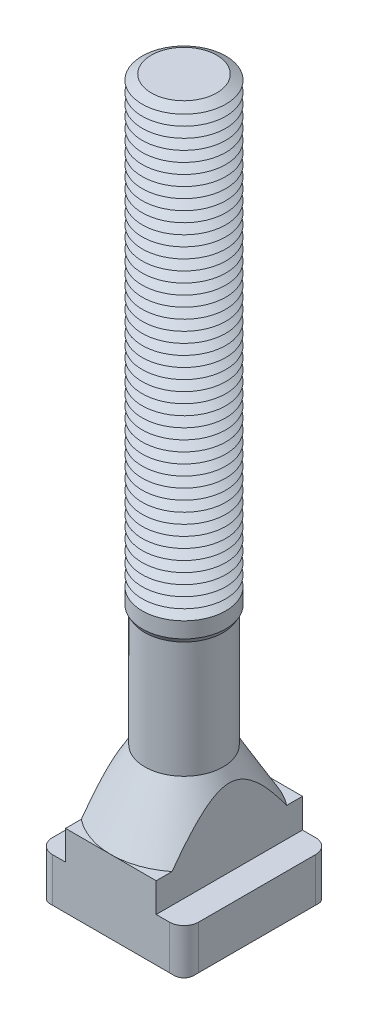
ISO-10303-21;
HEADER;
FILE_DESCRIPTION(('STEP AP214'),'2;1');
FILE_NAME('part.step','',(''),(''),'','','');
FILE_SCHEMA(('AUTOMOTIVE_DESIGN { 1 0 10303 214 1 1 1 1 }'));
ENDSEC;
DATA;
#1=APPLICATION_CONTEXT('core data for automotive mechanical design processes');
#2=APPLICATION_PROTOCOL_DEFINITION('international standard','automotive_design',2000,#1);
#3=PRODUCT_CONTEXT('',#1,'mechanical');
#4=PRODUCT('Part','Part','',(#3));
#5=PRODUCT_RELATED_PRODUCT_CATEGORY('part','',(#4));
#6=PRODUCT_DEFINITION_FORMATION('','',#4);
#7=PRODUCT_DEFINITION_CONTEXT('part definition',#1,'design');
#8=PRODUCT_DEFINITION('design','',#6,#7);
#9=PRODUCT_DEFINITION_SHAPE('','',#8);
#10=(LENGTH_UNIT() NAMED_UNIT(*) SI_UNIT(.MILLI.,.METRE.));
#11=(NAMED_UNIT(*) PLANE_ANGLE_UNIT() SI_UNIT($,.RADIAN.));
#12=(NAMED_UNIT(*) SI_UNIT($,.STERADIAN.) SOLID_ANGLE_UNIT());
#13=UNCERTAINTY_MEASURE_WITH_UNIT(LENGTH_MEASURE(1.E-05),#10,'distance_accuracy_value','');
#14=(GEOMETRIC_REPRESENTATION_CONTEXT(3) GLOBAL_UNCERTAINTY_ASSIGNED_CONTEXT((#13)) GLOBAL_UNIT_ASSIGNED_CONTEXT((#10,
#11,#12)) REPRESENTATION_CONTEXT('',''));
#15=CARTESIAN_POINT('',(0.,0.,0.));
#16=DIRECTION('',(0.,0.,1.));
#17=DIRECTION('',(1.,0.,0.));
#18=AXIS2_PLACEMENT_3D('',#15,#16,#17);
#19=CARTESIAN_POINT('',(0.,164.,0.));
#20=DIRECTION('',(0.,-1.,0.));
#21=DIRECTION('',(0.,0.,-1.));
#22=AXIS2_PLACEMENT_3D('',#19,#20,#21);
#23=CONICAL_SURFACE('',#22,7.83493649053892,1.0471975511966);
#24=CARTESIAN_POINT('',(0.,162.75,0.));
#25=DIRECTION('',(0.,-1.,0.));
#26=DIRECTION('',(0.,0.,-1.));
#27=AXIS2_PLACEMENT_3D('',#24,#25,#26);
#28=CIRCLE('',#27,10.);
#29=CARTESIAN_POINT('',(0.,162.75,-10.));
#30=VERTEX_POINT('',#29);
#31=EDGE_CURVE('E832',#30,#30,#28,.T.);
#32=ORIENTED_EDGE('',*,*,#31,.F.);
#33=EDGE_LOOP('',(#32));
#34=FACE_BOUND('',#33,.T.);
#35=CARTESIAN_POINT('',(0.,164.,0.));
#36=DIRECTION('',(0.,-1.,0.));
#37=DIRECTION('',(0.,0.,-1.));
#38=AXIS2_PLACEMENT_3D('',#35,#36,#37);
#39=CIRCLE('',#38,7.83493649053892);
#40=CARTESIAN_POINT('',(0.,164.,-7.83493649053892));
#41=VERTEX_POINT('',#40);
#42=EDGE_CURVE('E836',#41,#41,#39,.T.);
#43=ORIENTED_EDGE('',*,*,#42,.T.);
#44=EDGE_LOOP('',(#43));
#45=FACE_BOUND('',#44,.T.);
#46=ADVANCED_FACE('F39',(#34,#45),#23,.T.);
#47=CARTESIAN_POINT('',(0.,165.25,0.));
#48=DIRECTION('',(0.,1.,0.));
#49=DIRECTION('',(0.,0.,1.));
#50=AXIS2_PLACEMENT_3D('',#47,#48,#49);
#51=CONICAL_SURFACE('',#50,10.,1.0471975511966);
#52=ORIENTED_EDGE('',*,*,#42,.F.);
#53=EDGE_LOOP('',(#52));
#54=FACE_BOUND('',#53,.T.);
#55=CARTESIAN_POINT('',(0.,165.25,0.));
#56=DIRECTION('',(0.,-1.,0.));
#57=DIRECTION('',(0.,0.,-1.));
#58=AXIS2_PLACEMENT_3D('',#55,#56,#57);
#59=CIRCLE('',#58,10.);
#60=CARTESIAN_POINT('',(0.,165.25,-10.));
#61=VERTEX_POINT('',#60);
#62=EDGE_CURVE('E839',#61,#61,#59,.T.);
#63=ORIENTED_EDGE('',*,*,#62,.T.);
#64=EDGE_LOOP('',(#63));
#65=FACE_BOUND('',#64,.T.);
#66=ADVANCED_FACE('F450',(#54,#65),#51,.T.);
#67=CARTESIAN_POINT('',(4.55328819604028,174.,0.));
#68=DIRECTION('',(0.,-1.,0.));
#69=DIRECTION('',(1.,0.,0.));
#70=AXIS2_PLACEMENT_3D('',#67,#68,#69);
#71=PLANE('',#70);
#72=CARTESIAN_POINT('',(0.,174.,0.));
#73=DIRECTION('',(0.,-1.,0.));
#74=DIRECTION('',(0.,0.,-1.));
#75=AXIS2_PLACEMENT_3D('',#72,#73,#74);
#76=CIRCLE('',#75,7.83493649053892);
#77=CARTESIAN_POINT('',(0.,174.,-7.83493649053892));
#78=VERTEX_POINT('',#77);
#79=EDGE_CURVE('E800',#78,#78,#76,.T.);
#80=ORIENTED_EDGE('',*,*,#79,.F.);
#81=EDGE_LOOP('',(#80));
#82=FACE_BOUND('',#81,.T.);
#83=ADVANCED_FACE('F456',(#82),#71,.F.);
#84=CARTESIAN_POINT('',(0.,174.,0.));
#85=DIRECTION('',(0.,-1.,0.));
#86=DIRECTION('',(0.,0.,-1.));
#87=AXIS2_PLACEMENT_3D('',#84,#85,#86);
#88=CONICAL_SURFACE('',#87,7.83493649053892,1.0471975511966);
#89=CARTESIAN_POINT('',(0.,172.75,0.));
#90=DIRECTION('',(0.,-1.,0.));
#91=DIRECTION('',(0.,0.,-1.));
#92=AXIS2_PLACEMENT_3D('',#89,#90,#91);
#93=CIRCLE('',#92,10.);
#94=CARTESIAN_POINT('',(0.,172.75,-10.));
#95=VERTEX_POINT('',#94);
#96=EDGE_CURVE('E804',#95,#95,#93,.T.);
#97=ORIENTED_EDGE('',*,*,#96,.F.);
#98=EDGE_LOOP('',(#97));
#99=FACE_BOUND('',#98,.T.);
#100=ORIENTED_EDGE('',*,*,#79,.T.);
#101=EDGE_LOOP('',(#100));
#102=FACE_BOUND('',#101,.T.);
#103=ADVANCED_FACE('F484',(#99,#102),#88,.T.);
#104=CARTESIAN_POINT('',(0.,172.75,0.));
#105=DIRECTION('',(0.,1.,0.));
#106=DIRECTION('',(0.,0.,1.));
#107=AXIS2_PLACEMENT_3D('',#104,#105,#106);
#108=CONICAL_SURFACE('',#107,10.,1.0471975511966);
#109=CARTESIAN_POINT('',(0.,171.5,0.));
#110=DIRECTION('',(0.,-1.,0.));
#111=DIRECTION('',(0.,0.,-1.));
#112=AXIS2_PLACEMENT_3D('',#109,#110,#111);
#113=CIRCLE('',#112,7.83493649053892);
#114=CARTESIAN_POINT('',(0.,171.5,-7.83493649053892));
#115=VERTEX_POINT('',#114);
#116=EDGE_CURVE('E766',#115,#115,#113,.T.);
#117=ORIENTED_EDGE('',*,*,#116,.F.);
#118=EDGE_LOOP('',(#117));
#119=FACE_BOUND('',#118,.T.);
#120=ORIENTED_EDGE('',*,*,#96,.T.);
#121=EDGE_LOOP('',(#120));
#122=FACE_BOUND('',#121,.T.);
#123=ADVANCED_FACE('F481',(#119,#122),#108,.T.);
#124=CARTESIAN_POINT('',(0.,171.5,0.));
#125=DIRECTION('',(0.,-1.,0.));
#126=DIRECTION('',(0.,0.,-1.));
#127=AXIS2_PLACEMENT_3D('',#124,#125,#126);
#128=CONICAL_SURFACE('',#127,7.83493649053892,1.0471975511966);
#129=CARTESIAN_POINT('',(0.,170.25,0.));
#130=DIRECTION('',(0.,-1.,0.));
#131=DIRECTION('',(0.,0.,-1.));
#132=AXIS2_PLACEMENT_3D('',#129,#130,#131);
#133=CIRCLE('',#132,10.);
#134=CARTESIAN_POINT('',(0.,170.25,-10.));
#135=VERTEX_POINT('',#134);
#136=EDGE_CURVE('E764',#135,#135,#133,.T.);
#137=ORIENTED_EDGE('',*,*,#136,.F.);
#138=EDGE_LOOP('',(#137));
#139=FACE_BOUND('',#138,.T.);
#140=ORIENTED_EDGE('',*,*,#116,.T.);
#141=EDGE_LOOP('',(#140));
#142=FACE_BOUND('',#141,.T.);
#143=ADVANCED_FACE('F476',(#139,#142),#128,.T.);
#144=CARTESIAN_POINT('',(0.,170.25,0.));
#145=DIRECTION('',(0.,1.,0.));
#146=DIRECTION('',(0.,0.,1.));
#147=AXIS2_PLACEMENT_3D('',#144,#145,#146);
#148=CONICAL_SURFACE('',#147,10.,1.0471975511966);
#149=CARTESIAN_POINT('',(0.,169.,0.));
#150=DIRECTION('',(0.,-1.,0.));
#151=DIRECTION('',(0.,0.,-1.));
#152=AXIS2_PLACEMENT_3D('',#149,#150,#151);
#153=CIRCLE('',#152,7.83493649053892);
#154=CARTESIAN_POINT('',(0.,169.,-7.83493649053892));
#155=VERTEX_POINT('',#154);
#156=EDGE_CURVE('E767',#155,#155,#153,.T.);
#157=ORIENTED_EDGE('',*,*,#156,.F.);
#158=EDGE_LOOP('',(#157));
#159=FACE_BOUND('',#158,.T.);
#160=ORIENTED_EDGE('',*,*,#136,.T.);
#161=EDGE_LOOP('',(#160));
#162=FACE_BOUND('',#161,.T.);
#163=ADVANCED_FACE('F473',(#159,#162),#148,.T.);
#164=CARTESIAN_POINT('',(0.,169.,0.));
#165=DIRECTION('',(0.,-1.,0.));
#166=DIRECTION('',(0.,0.,-1.));
#167=AXIS2_PLACEMENT_3D('',#164,#165,#166);
#168=CONICAL_SURFACE('',#167,7.83493649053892,1.0471975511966);
#169=CARTESIAN_POINT('',(0.,167.75,0.));
#170=DIRECTION('',(0.,-1.,0.));
#171=DIRECTION('',(0.,0.,-1.));
#172=AXIS2_PLACEMENT_3D('',#169,#170,#171);
#173=CIRCLE('',#172,10.);
#174=CARTESIAN_POINT('',(0.,167.75,-10.));
#175=VERTEX_POINT('',#174);
#176=EDGE_CURVE('E846',#175,#175,#173,.T.);
#177=ORIENTED_EDGE('',*,*,#176,.F.);
#178=EDGE_LOOP('',(#177));
#179=FACE_BOUND('',#178,.T.);
#180=ORIENTED_EDGE('',*,*,#156,.T.);
#181=EDGE_LOOP('',(#180));
#182=FACE_BOUND('',#181,.T.);
#183=ADVANCED_FACE('F467',(#179,#182),#168,.T.);
#184=CARTESIAN_POINT('',(0.,167.75,0.));
#185=DIRECTION('',(0.,1.,0.));
#186=DIRECTION('',(0.,0.,1.));
#187=AXIS2_PLACEMENT_3D('',#184,#185,#186);
#188=CONICAL_SURFACE('',#187,10.,1.0471975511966);
#189=CARTESIAN_POINT('',(0.,166.5,0.));
#190=DIRECTION('',(0.,-1.,0.));
#191=DIRECTION('',(0.,0.,-1.));
#192=AXIS2_PLACEMENT_3D('',#189,#190,#191);
#193=CIRCLE('',#192,7.83493649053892);
#194=CARTESIAN_POINT('',(0.,166.5,-7.83493649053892));
#195=VERTEX_POINT('',#194);
#196=EDGE_CURVE('E843',#195,#195,#193,.T.);
#197=ORIENTED_EDGE('',*,*,#196,.F.);
#198=EDGE_LOOP('',(#197));
#199=FACE_BOUND('',#198,.T.);
#200=ORIENTED_EDGE('',*,*,#176,.T.);
#201=EDGE_LOOP('',(#200));
#202=FACE_BOUND('',#201,.T.);
#203=ADVANCED_FACE('F463',(#199,#202),#188,.T.);
#204=CARTESIAN_POINT('',(0.,166.5,0.));
#205=DIRECTION('',(0.,-1.,0.));
#206=DIRECTION('',(0.,0.,-1.));
#207=AXIS2_PLACEMENT_3D('',#204,#205,#206);
#208=CONICAL_SURFACE('',#207,7.83493649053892,1.0471975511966);
#209=ORIENTED_EDGE('',*,*,#62,.F.);
#210=EDGE_LOOP('',(#209));
#211=FACE_BOUND('',#210,.T.);
#212=ORIENTED_EDGE('',*,*,#196,.T.);
#213=EDGE_LOOP('',(#212));
#214=FACE_BOUND('',#213,.T.);
#215=ADVANCED_FACE('F466',(#211,#214),#208,.T.);
#216=CARTESIAN_POINT('',(0.,161.5,0.));
#217=DIRECTION('',(0.,-1.,0.));
#218=DIRECTION('',(0.,0.,-1.));
#219=AXIS2_PLACEMENT_3D('',#216,#217,#218);
#220=CONICAL_SURFACE('',#219,7.83493649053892,1.0471975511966);
#221=CARTESIAN_POINT('',(0.,160.25,0.));
#222=DIRECTION('',(0.,-1.,0.));
#223=DIRECTION('',(0.,0.,-1.));
#224=AXIS2_PLACEMENT_3D('',#221,#222,#223);
#225=CIRCLE('',#224,10.);
#226=CARTESIAN_POINT('',(0.,160.25,-10.));
#227=VERTEX_POINT('',#226);
#228=EDGE_CURVE('E702',#227,#227,#225,.T.);
#229=ORIENTED_EDGE('',*,*,#228,.F.);
#230=EDGE_LOOP('',(#229));
#231=FACE_BOUND('',#230,.T.);
#232=CARTESIAN_POINT('',(0.,161.5,0.));
#233=DIRECTION('',(0.,-1.,0.));
#234=DIRECTION('',(0.,0.,-1.));
#235=AXIS2_PLACEMENT_3D('',#232,#233,#234);
#236=CIRCLE('',#235,7.83493649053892);
#237=CARTESIAN_POINT('',(0.,161.5,-7.83493649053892));
#238=VERTEX_POINT('',#237);
#239=EDGE_CURVE('E704',#238,#238,#236,.T.);
#240=ORIENTED_EDGE('',*,*,#239,.T.);
#241=EDGE_LOOP('',(#240));
#242=FACE_BOUND('',#241,.T.);
#243=ADVANCED_FACE('F471',(#231,#242),#220,.T.);
#244=CARTESIAN_POINT('',(0.,162.75,0.));
#245=DIRECTION('',(0.,1.,0.));
#246=DIRECTION('',(0.,0.,1.));
#247=AXIS2_PLACEMENT_3D('',#244,#245,#246);
#248=CONICAL_SURFACE('',#247,10.,1.0471975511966);
#249=ORIENTED_EDGE('',*,*,#239,.F.);
#250=EDGE_LOOP('',(#249));
#251=FACE_BOUND('',#250,.T.);
#252=ORIENTED_EDGE('',*,*,#31,.T.);
#253=EDGE_LOOP('',(#252));
#254=FACE_BOUND('',#253,.T.);
#255=ADVANCED_FACE('F938',(#251,#254),#248,.T.);
#256=CARTESIAN_POINT('',(0.,159.,0.));
#257=DIRECTION('',(0.,-1.,0.));
#258=DIRECTION('',(0.,0.,-1.));
#259=AXIS2_PLACEMENT_3D('',#256,#257,#258);
#260=CONICAL_SURFACE('',#259,7.83493649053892,1.0471975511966);
#261=CARTESIAN_POINT('',(0.,157.75,0.));
#262=DIRECTION('',(0.,-1.,0.));
#263=DIRECTION('',(0.,0.,-1.));
#264=AXIS2_PLACEMENT_3D('',#261,#262,#263);
#265=CIRCLE('',#264,10.);
#266=CARTESIAN_POINT('',(0.,157.75,-10.));
#267=VERTEX_POINT('',#266);
#268=EDGE_CURVE('E696',#267,#267,#265,.T.);
#269=ORIENTED_EDGE('',*,*,#268,.F.);
#270=EDGE_LOOP('',(#269));
#271=FACE_BOUND('',#270,.T.);
#272=CARTESIAN_POINT('',(0.,159.,0.));
#273=DIRECTION('',(0.,-1.,0.));
#274=DIRECTION('',(0.,0.,-1.));
#275=AXIS2_PLACEMENT_3D('',#272,#273,#274);
#276=CIRCLE('',#275,7.83493649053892);
#277=CARTESIAN_POINT('',(0.,159.,-7.83493649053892));
#278=VERTEX_POINT('',#277);
#279=EDGE_CURVE('E699',#278,#278,#276,.T.);
#280=ORIENTED_EDGE('',*,*,#279,.T.);
#281=EDGE_LOOP('',(#280));
#282=FACE_BOUND('',#281,.T.);
#283=ADVANCED_FACE('F935',(#271,#282),#260,.T.);
#284=CARTESIAN_POINT('',(0.,160.25,0.));
#285=DIRECTION('',(0.,1.,0.));
#286=DIRECTION('',(0.,0.,1.));
#287=AXIS2_PLACEMENT_3D('',#284,#285,#286);
#288=CONICAL_SURFACE('',#287,10.,1.0471975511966);
#289=ORIENTED_EDGE('',*,*,#279,.F.);
#290=EDGE_LOOP('',(#289));
#291=FACE_BOUND('',#290,.T.);
#292=ORIENTED_EDGE('',*,*,#228,.T.);
#293=EDGE_LOOP('',(#292));
#294=FACE_BOUND('',#293,.T.);
#295=ADVANCED_FACE('F937',(#291,#294),#288,.T.);
#296=CARTESIAN_POINT('',(0.,156.5,0.));
#297=DIRECTION('',(0.,-1.,0.));
#298=DIRECTION('',(0.,0.,-1.));
#299=AXIS2_PLACEMENT_3D('',#296,#297,#298);
#300=CONICAL_SURFACE('',#299,7.83493649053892,1.0471975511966);
#301=CARTESIAN_POINT('',(0.,155.25,0.));
#302=DIRECTION('',(0.,-1.,0.));
#303=DIRECTION('',(0.,0.,-1.));
#304=AXIS2_PLACEMENT_3D('',#301,#302,#303);
#305=CIRCLE('',#304,10.);
#306=CARTESIAN_POINT('',(0.,155.25,-10.));
#307=VERTEX_POINT('',#306);
#308=EDGE_CURVE('E783',#307,#307,#305,.T.);
#309=ORIENTED_EDGE('',*,*,#308,.F.);
#310=EDGE_LOOP('',(#309));
#311=FACE_BOUND('',#310,.T.);
#312=CARTESIAN_POINT('',(0.,156.5,0.));
#313=DIRECTION('',(0.,-1.,0.));
#314=DIRECTION('',(0.,0.,-1.));
#315=AXIS2_PLACEMENT_3D('',#312,#313,#314);
#316=CIRCLE('',#315,7.83493649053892);
#317=CARTESIAN_POINT('',(0.,156.5,-7.83493649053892));
#318=VERTEX_POINT('',#317);
#319=EDGE_CURVE('E700',#318,#318,#316,.T.);
#320=ORIENTED_EDGE('',*,*,#319,.T.);
#321=EDGE_LOOP('',(#320));
#322=FACE_BOUND('',#321,.T.);
#323=ADVANCED_FACE('F926',(#311,#322),#300,.T.);
#324=CARTESIAN_POINT('',(0.,157.75,0.));
#325=DIRECTION('',(0.,1.,0.));
#326=DIRECTION('',(0.,0.,1.));
#327=AXIS2_PLACEMENT_3D('',#324,#325,#326);
#328=CONICAL_SURFACE('',#327,10.,1.0471975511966);
#329=ORIENTED_EDGE('',*,*,#319,.F.);
#330=EDGE_LOOP('',(#329));
#331=FACE_BOUND('',#330,.T.);
#332=ORIENTED_EDGE('',*,*,#268,.T.);
#333=EDGE_LOOP('',(#332));
#334=FACE_BOUND('',#333,.T.);
#335=ADVANCED_FACE('F928',(#331,#334),#328,.T.);
#336=CARTESIAN_POINT('',(0.,154.,0.));
#337=DIRECTION('',(0.,-1.,0.));
#338=DIRECTION('',(0.,0.,-1.));
#339=AXIS2_PLACEMENT_3D('',#336,#337,#338);
#340=CONICAL_SURFACE('',#339,7.83493649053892,1.0471975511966);
#341=CARTESIAN_POINT('',(0.,152.75,0.));
#342=DIRECTION('',(0.,-1.,0.));
#343=DIRECTION('',(0.,0.,-1.));
#344=AXIS2_PLACEMENT_3D('',#341,#342,#343);
#345=CIRCLE('',#344,10.);
#346=CARTESIAN_POINT('',(0.,152.75,-10.));
#347=VERTEX_POINT('',#346);
#348=EDGE_CURVE('E652',#347,#347,#345,.T.);
#349=ORIENTED_EDGE('',*,*,#348,.F.);
#350=EDGE_LOOP('',(#349));
#351=FACE_BOUND('',#350,.T.);
#352=CARTESIAN_POINT('',(0.,154.,0.));
#353=DIRECTION('',(0.,-1.,0.));
#354=DIRECTION('',(0.,0.,-1.));
#355=AXIS2_PLACEMENT_3D('',#352,#353,#354);
#356=CIRCLE('',#355,7.83493649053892);
#357=CARTESIAN_POINT('',(0.,154.,-7.83493649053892));
#358=VERTEX_POINT('',#357);
#359=EDGE_CURVE('E654',#358,#358,#356,.T.);
#360=ORIENTED_EDGE('',*,*,#359,.T.);
#361=EDGE_LOOP('',(#360));
#362=FACE_BOUND('',#361,.T.);
#363=ADVANCED_FACE('F931',(#351,#362),#340,.T.);
#364=CARTESIAN_POINT('',(0.,155.25,0.));
#365=DIRECTION('',(0.,1.,0.));
#366=DIRECTION('',(0.,0.,1.));
#367=AXIS2_PLACEMENT_3D('',#364,#365,#366);
#368=CONICAL_SURFACE('',#367,10.,1.0471975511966);
#369=ORIENTED_EDGE('',*,*,#359,.F.);
#370=EDGE_LOOP('',(#369));
#371=FACE_BOUND('',#370,.T.);
#372=ORIENTED_EDGE('',*,*,#308,.T.);
#373=EDGE_LOOP('',(#372));
#374=FACE_BOUND('',#373,.T.);
#375=ADVANCED_FACE('F990',(#371,#374),#368,.T.);
#376=CARTESIAN_POINT('',(0.,151.5,0.));
#377=DIRECTION('',(0.,-1.,0.));
#378=DIRECTION('',(0.,0.,-1.));
#379=AXIS2_PLACEMENT_3D('',#376,#377,#378);
#380=CONICAL_SURFACE('',#379,7.83493649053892,1.0471975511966);
#381=CARTESIAN_POINT('',(0.,150.25,0.));
#382=DIRECTION('',(0.,-1.,0.));
#383=DIRECTION('',(0.,0.,-1.));
#384=AXIS2_PLACEMENT_3D('',#381,#382,#383);
#385=CIRCLE('',#384,10.);
#386=CARTESIAN_POINT('',(0.,150.25,-10.));
#387=VERTEX_POINT('',#386);
#388=EDGE_CURVE('E720',#387,#387,#385,.T.);
#389=ORIENTED_EDGE('',*,*,#388,.F.);
#390=EDGE_LOOP('',(#389));
#391=FACE_BOUND('',#390,.T.);
#392=CARTESIAN_POINT('',(0.,151.5,0.));
#393=DIRECTION('',(0.,-1.,0.));
#394=DIRECTION('',(0.,0.,-1.));
#395=AXIS2_PLACEMENT_3D('',#392,#393,#394);
#396=CIRCLE('',#395,7.83493649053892);
#397=CARTESIAN_POINT('',(0.,151.5,-7.83493649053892));
#398=VERTEX_POINT('',#397);
#399=EDGE_CURVE('E655',#398,#398,#396,.T.);
#400=ORIENTED_EDGE('',*,*,#399,.T.);
#401=EDGE_LOOP('',(#400));
#402=FACE_BOUND('',#401,.T.);
#403=ADVANCED_FACE('F999',(#391,#402),#380,.T.);
#404=CARTESIAN_POINT('',(0.,152.75,0.));
#405=DIRECTION('',(0.,1.,0.));
#406=DIRECTION('',(0.,0.,1.));
#407=AXIS2_PLACEMENT_3D('',#404,#405,#406);
#408=CONICAL_SURFACE('',#407,10.,1.0471975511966);
#409=ORIENTED_EDGE('',*,*,#399,.F.);
#410=EDGE_LOOP('',(#409));
#411=FACE_BOUND('',#410,.T.);
#412=ORIENTED_EDGE('',*,*,#348,.T.);
#413=EDGE_LOOP('',(#412));
#414=FACE_BOUND('',#413,.T.);
#415=ADVANCED_FACE('F1008',(#411,#414),#408,.T.);
#416=CARTESIAN_POINT('',(0.,149.,0.));
#417=DIRECTION('',(0.,-1.,0.));
#418=DIRECTION('',(0.,0.,-1.));
#419=AXIS2_PLACEMENT_3D('',#416,#417,#418);
#420=CONICAL_SURFACE('',#419,7.83493649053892,1.0471975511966);
#421=CARTESIAN_POINT('',(0.,147.75,0.));
#422=DIRECTION('',(0.,-1.,0.));
#423=DIRECTION('',(0.,0.,-1.));
#424=AXIS2_PLACEMENT_3D('',#421,#422,#423);
#425=CIRCLE('',#424,10.);
#426=CARTESIAN_POINT('',(0.,147.75,-10.));
#427=VERTEX_POINT('',#426);
#428=EDGE_CURVE('E721',#427,#427,#425,.T.);
#429=ORIENTED_EDGE('',*,*,#428,.F.);
#430=EDGE_LOOP('',(#429));
#431=FACE_BOUND('',#430,.T.);
#432=CARTESIAN_POINT('',(0.,149.,0.));
#433=DIRECTION('',(0.,-1.,0.));
#434=DIRECTION('',(0.,0.,-1.));
#435=AXIS2_PLACEMENT_3D('',#432,#433,#434);
#436=CIRCLE('',#435,7.83493649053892);
#437=CARTESIAN_POINT('',(0.,149.,-7.83493649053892));
#438=VERTEX_POINT('',#437);
#439=EDGE_CURVE('E718',#438,#438,#436,.T.);
#440=ORIENTED_EDGE('',*,*,#439,.T.);
#441=EDGE_LOOP('',(#440));
#442=FACE_BOUND('',#441,.T.);
#443=ADVANCED_FACE('F1017',(#431,#442),#420,.T.);
#444=CARTESIAN_POINT('',(0.,150.25,0.));
#445=DIRECTION('',(0.,1.,0.));
#446=DIRECTION('',(0.,0.,1.));
#447=AXIS2_PLACEMENT_3D('',#444,#445,#446);
#448=CONICAL_SURFACE('',#447,10.,1.0471975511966);
#449=ORIENTED_EDGE('',*,*,#439,.F.);
#450=EDGE_LOOP('',(#449));
#451=FACE_BOUND('',#450,.T.);
#452=ORIENTED_EDGE('',*,*,#388,.T.);
#453=EDGE_LOOP('',(#452));
#454=FACE_BOUND('',#453,.T.);
#455=ADVANCED_FACE('F1026',(#451,#454),#448,.T.);
#456=CARTESIAN_POINT('',(0.,146.5,0.));
#457=DIRECTION('',(0.,-1.,0.));
#458=DIRECTION('',(0.,0.,-1.));
#459=AXIS2_PLACEMENT_3D('',#456,#457,#458);
#460=CONICAL_SURFACE('',#459,7.83493649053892,1.0471975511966);
#461=CARTESIAN_POINT('',(0.,145.25,0.));
#462=DIRECTION('',(0.,-1.,0.));
#463=DIRECTION('',(0.,0.,-1.));
#464=AXIS2_PLACEMENT_3D('',#461,#462,#463);
#465=CIRCLE('',#464,10.);
#466=CARTESIAN_POINT('',(0.,145.25,-10.));
#467=VERTEX_POINT('',#466);
#468=EDGE_CURVE('E668',#467,#467,#465,.T.);
#469=ORIENTED_EDGE('',*,*,#468,.F.);
#470=EDGE_LOOP('',(#469));
#471=FACE_BOUND('',#470,.T.);
#472=CARTESIAN_POINT('',(0.,146.5,0.));
#473=DIRECTION('',(0.,-1.,0.));
#474=DIRECTION('',(0.,0.,-1.));
#475=AXIS2_PLACEMENT_3D('',#472,#473,#474);
#476=CIRCLE('',#475,7.83493649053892);
#477=CARTESIAN_POINT('',(0.,146.5,-7.83493649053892));
#478=VERTEX_POINT('',#477);
#479=EDGE_CURVE('E876',#478,#478,#476,.T.);
#480=ORIENTED_EDGE('',*,*,#479,.T.);
#481=EDGE_LOOP('',(#480));
#482=FACE_BOUND('',#481,.T.);
#483=ADVANCED_FACE('F1035',(#471,#482),#460,.T.);
#484=CARTESIAN_POINT('',(0.,147.75,0.));
#485=DIRECTION('',(0.,1.,0.));
#486=DIRECTION('',(0.,0.,1.));
#487=AXIS2_PLACEMENT_3D('',#484,#485,#486);
#488=CONICAL_SURFACE('',#487,10.,1.0471975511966);
#489=ORIENTED_EDGE('',*,*,#479,.F.);
#490=EDGE_LOOP('',(#489));
#491=FACE_BOUND('',#490,.T.);
#492=ORIENTED_EDGE('',*,*,#428,.T.);
#493=EDGE_LOOP('',(#492));
#494=FACE_BOUND('',#493,.T.);
#495=ADVANCED_FACE('F1044',(#491,#494),#488,.T.);
#496=CARTESIAN_POINT('',(0.,144.,0.));
#497=DIRECTION('',(0.,-1.,0.));
#498=DIRECTION('',(0.,0.,-1.));
#499=AXIS2_PLACEMENT_3D('',#496,#497,#498);
#500=CONICAL_SURFACE('',#499,7.83493649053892,1.0471975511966);
#501=CARTESIAN_POINT('',(0.,142.75,0.));
#502=DIRECTION('',(0.,-1.,0.));
#503=DIRECTION('',(0.,0.,-1.));
#504=AXIS2_PLACEMENT_3D('',#501,#502,#503);
#505=CIRCLE('',#504,10.);
#506=CARTESIAN_POINT('',(0.,142.75,-10.));
#507=VERTEX_POINT('',#506);
#508=EDGE_CURVE('E669',#507,#507,#505,.T.);
#509=ORIENTED_EDGE('',*,*,#508,.F.);
#510=EDGE_LOOP('',(#509));
#511=FACE_BOUND('',#510,.T.);
#512=CARTESIAN_POINT('',(0.,144.,0.));
#513=DIRECTION('',(0.,-1.,0.));
#514=DIRECTION('',(0.,0.,-1.));
#515=AXIS2_PLACEMENT_3D('',#512,#513,#514);
#516=CIRCLE('',#515,7.83493649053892);
#517=CARTESIAN_POINT('',(0.,144.,-7.83493649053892));
#518=VERTEX_POINT('',#517);
#519=EDGE_CURVE('E666',#518,#518,#516,.T.);
#520=ORIENTED_EDGE('',*,*,#519,.T.);
#521=EDGE_LOOP('',(#520));
#522=FACE_BOUND('',#521,.T.);
#523=ADVANCED_FACE('F1053',(#511,#522),#500,.T.);
#524=CARTESIAN_POINT('',(0.,145.25,0.));
#525=DIRECTION('',(0.,1.,0.));
#526=DIRECTION('',(0.,0.,1.));
#527=AXIS2_PLACEMENT_3D('',#524,#525,#526);
#528=CONICAL_SURFACE('',#527,10.,1.0471975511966);
#529=ORIENTED_EDGE('',*,*,#519,.F.);
#530=EDGE_LOOP('',(#529));
#531=FACE_BOUND('',#530,.T.);
#532=ORIENTED_EDGE('',*,*,#468,.T.);
#533=EDGE_LOOP('',(#532));
#534=FACE_BOUND('',#533,.T.);
#535=ADVANCED_FACE('F1062',(#531,#534),#528,.T.);
#536=CARTESIAN_POINT('',(0.,141.5,0.));
#537=DIRECTION('',(0.,-1.,0.));
#538=DIRECTION('',(0.,0.,-1.));
#539=AXIS2_PLACEMENT_3D('',#536,#537,#538);
#540=CONICAL_SURFACE('',#539,7.83493649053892,1.0471975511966);
#541=CARTESIAN_POINT('',(0.,140.25,0.));
#542=DIRECTION('',(0.,-1.,0.));
#543=DIRECTION('',(0.,0.,-1.));
#544=AXIS2_PLACEMENT_3D('',#541,#542,#543);
#545=CIRCLE('',#544,10.);
#546=CARTESIAN_POINT('',(0.,140.25,-10.));
#547=VERTEX_POINT('',#546);
#548=EDGE_CURVE('E794',#547,#547,#545,.T.);
#549=ORIENTED_EDGE('',*,*,#548,.F.);
#550=EDGE_LOOP('',(#549));
#551=FACE_BOUND('',#550,.T.);
#552=CARTESIAN_POINT('',(0.,141.5,0.));
#553=DIRECTION('',(0.,-1.,0.));
#554=DIRECTION('',(0.,0.,-1.));
#555=AXIS2_PLACEMENT_3D('',#552,#553,#554);
#556=CIRCLE('',#555,7.83493649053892);
#557=CARTESIAN_POINT('',(0.,141.5,-7.83493649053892));
#558=VERTEX_POINT('',#557);
#559=EDGE_CURVE('E797',#558,#558,#556,.T.);
#560=ORIENTED_EDGE('',*,*,#559,.T.);
#561=EDGE_LOOP('',(#560));
#562=FACE_BOUND('',#561,.T.);
#563=ADVANCED_FACE('F1071',(#551,#562),#540,.T.);
#564=CARTESIAN_POINT('',(0.,142.75,0.));
#565=DIRECTION('',(0.,1.,0.));
#566=DIRECTION('',(0.,0.,1.));
#567=AXIS2_PLACEMENT_3D('',#564,#565,#566);
#568=CONICAL_SURFACE('',#567,10.,1.0471975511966);
#569=ORIENTED_EDGE('',*,*,#559,.F.);
#570=EDGE_LOOP('',(#569));
#571=FACE_BOUND('',#570,.T.);
#572=ORIENTED_EDGE('',*,*,#508,.T.);
#573=EDGE_LOOP('',(#572));
#574=FACE_BOUND('',#573,.T.);
#575=ADVANCED_FACE('F1080',(#571,#574),#568,.T.);
#576=CARTESIAN_POINT('',(0.,139.,0.));
#577=DIRECTION('',(0.,-1.,0.));
#578=DIRECTION('',(0.,0.,-1.));
#579=AXIS2_PLACEMENT_3D('',#576,#577,#578);
#580=CONICAL_SURFACE('',#579,7.83493649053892,1.0471975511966);
#581=CARTESIAN_POINT('',(0.,137.75,0.));
#582=DIRECTION('',(0.,-1.,0.));
#583=DIRECTION('',(0.,0.,-1.));
#584=AXIS2_PLACEMENT_3D('',#581,#582,#583);
#585=CIRCLE('',#584,10.);
#586=CARTESIAN_POINT('',(0.,137.75,-10.));
#587=VERTEX_POINT('',#586);
#588=EDGE_CURVE('E693',#587,#587,#585,.T.);
#589=ORIENTED_EDGE('',*,*,#588,.F.);
#590=EDGE_LOOP('',(#589));
#591=FACE_BOUND('',#590,.T.);
#592=CARTESIAN_POINT('',(0.,139.,0.));
#593=DIRECTION('',(0.,-1.,0.));
#594=DIRECTION('',(0.,0.,-1.));
#595=AXIS2_PLACEMENT_3D('',#592,#593,#594);
#596=CIRCLE('',#595,7.83493649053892);
#597=CARTESIAN_POINT('',(0.,139.,-7.83493649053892));
#598=VERTEX_POINT('',#597);
#599=EDGE_CURVE('E798',#598,#598,#596,.T.);
#600=ORIENTED_EDGE('',*,*,#599,.T.);
#601=EDGE_LOOP('',(#600));
#602=FACE_BOUND('',#601,.T.);
#603=ADVANCED_FACE('F1089',(#591,#602),#580,.T.);
#604=CARTESIAN_POINT('',(0.,140.25,0.));
#605=DIRECTION('',(0.,1.,0.));
#606=DIRECTION('',(0.,0.,1.));
#607=AXIS2_PLACEMENT_3D('',#604,#605,#606);
#608=CONICAL_SURFACE('',#607,10.,1.0471975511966);
#609=ORIENTED_EDGE('',*,*,#599,.F.);
#610=EDGE_LOOP('',(#609));
#611=FACE_BOUND('',#610,.T.);
#612=ORIENTED_EDGE('',*,*,#548,.T.);
#613=EDGE_LOOP('',(#612));
#614=FACE_BOUND('',#613,.T.);
#615=ADVANCED_FACE('F1098',(#611,#614),#608,.T.);
#616=CARTESIAN_POINT('',(0.,136.5,0.));
#617=DIRECTION('',(0.,-1.,0.));
#618=DIRECTION('',(0.,0.,-1.));
#619=AXIS2_PLACEMENT_3D('',#616,#617,#618);
#620=CONICAL_SURFACE('',#619,7.83493649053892,1.0471975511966);
#621=CARTESIAN_POINT('',(0.,135.25,0.));
#622=DIRECTION('',(0.,-1.,0.));
#623=DIRECTION('',(0.,0.,-1.));
#624=AXIS2_PLACEMENT_3D('',#621,#622,#623);
#625=CIRCLE('',#624,10.);
#626=CARTESIAN_POINT('',(0.,135.25,-10.));
#627=VERTEX_POINT('',#626);
#628=EDGE_CURVE('E694',#627,#627,#625,.T.);
#629=ORIENTED_EDGE('',*,*,#628,.F.);
#630=EDGE_LOOP('',(#629));
#631=FACE_BOUND('',#630,.T.);
#632=CARTESIAN_POINT('',(0.,136.5,0.));
#633=DIRECTION('',(0.,-1.,0.));
#634=DIRECTION('',(0.,0.,-1.));
#635=AXIS2_PLACEMENT_3D('',#632,#633,#634);
#636=CIRCLE('',#635,7.83493649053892);
#637=CARTESIAN_POINT('',(0.,136.5,-7.83493649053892));
#638=VERTEX_POINT('',#637);
#639=EDGE_CURVE('E690',#638,#638,#636,.T.);
#640=ORIENTED_EDGE('',*,*,#639,.T.);
#641=EDGE_LOOP('',(#640));
#642=FACE_BOUND('',#641,.T.);
#643=ADVANCED_FACE('F1107',(#631,#642),#620,.T.);
#644=CARTESIAN_POINT('',(0.,137.75,0.));
#645=DIRECTION('',(0.,1.,0.));
#646=DIRECTION('',(0.,0.,1.));
#647=AXIS2_PLACEMENT_3D('',#644,#645,#646);
#648=CONICAL_SURFACE('',#647,10.,1.0471975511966);
#649=ORIENTED_EDGE('',*,*,#639,.F.);
#650=EDGE_LOOP('',(#649));
#651=FACE_BOUND('',#650,.T.);
#652=ORIENTED_EDGE('',*,*,#588,.T.);
#653=EDGE_LOOP('',(#652));
#654=FACE_BOUND('',#653,.T.);
#655=ADVANCED_FACE('F1116',(#651,#654),#648,.T.);
#656=CARTESIAN_POINT('',(0.,134.,0.));
#657=DIRECTION('',(0.,-1.,0.));
#658=DIRECTION('',(0.,0.,-1.));
#659=AXIS2_PLACEMENT_3D('',#656,#657,#658);
#660=CONICAL_SURFACE('',#659,7.83493649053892,1.0471975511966);
#661=CARTESIAN_POINT('',(0.,132.75,0.));
#662=DIRECTION('',(0.,-1.,0.));
#663=DIRECTION('',(0.,0.,-1.));
#664=AXIS2_PLACEMENT_3D('',#661,#662,#663);
#665=CIRCLE('',#664,10.);
#666=CARTESIAN_POINT('',(0.,132.75,-10.));
#667=VERTEX_POINT('',#666);
#668=EDGE_CURVE('E2056',#667,#667,#665,.T.);
#669=ORIENTED_EDGE('',*,*,#668,.F.);
#670=EDGE_LOOP('',(#669));
#671=FACE_BOUND('',#670,.T.);
#672=CARTESIAN_POINT('',(0.,134.,0.));
#673=DIRECTION('',(0.,-1.,0.));
#674=DIRECTION('',(0.,0.,-1.));
#675=AXIS2_PLACEMENT_3D('',#672,#673,#674);
#676=CIRCLE('',#675,7.83493649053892);
#677=CARTESIAN_POINT('',(0.,134.,-7.83493649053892));
#678=VERTEX_POINT('',#677);
#679=EDGE_CURVE('E762',#678,#678,#676,.T.);
#680=ORIENTED_EDGE('',*,*,#679,.T.);
#681=EDGE_LOOP('',(#680));
#682=FACE_BOUND('',#681,.T.);
#683=ADVANCED_FACE('F1125',(#671,#682),#660,.T.);
#684=CARTESIAN_POINT('',(0.,135.25,0.));
#685=DIRECTION('',(0.,1.,0.));
#686=DIRECTION('',(0.,0.,1.));
#687=AXIS2_PLACEMENT_3D('',#684,#685,#686);
#688=CONICAL_SURFACE('',#687,10.,1.0471975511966);
#689=ORIENTED_EDGE('',*,*,#679,.F.);
#690=EDGE_LOOP('',(#689));
#691=FACE_BOUND('',#690,.T.);
#692=ORIENTED_EDGE('',*,*,#628,.T.);
#693=EDGE_LOOP('',(#692));
#694=FACE_BOUND('',#693,.T.);
#695=ADVANCED_FACE('F1134',(#691,#694),#688,.T.);
#696=CARTESIAN_POINT('',(0.,131.5,0.));
#697=DIRECTION('',(0.,-1.,0.));
#698=DIRECTION('',(0.,0.,-1.));
#699=AXIS2_PLACEMENT_3D('',#696,#697,#698);
#700=CONICAL_SURFACE('',#699,7.83493649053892,1.0471975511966);
#701=CARTESIAN_POINT('',(0.,130.25,0.));
#702=DIRECTION('',(0.,-1.,0.));
#703=DIRECTION('',(0.,0.,-1.));
#704=AXIS2_PLACEMENT_3D('',#701,#702,#703);
#705=CIRCLE('',#704,10.);
#706=CARTESIAN_POINT('',(0.,130.25,-10.));
#707=VERTEX_POINT('',#706);
#708=EDGE_CURVE('E684',#707,#707,#705,.T.);
#709=ORIENTED_EDGE('',*,*,#708,.F.);
#710=EDGE_LOOP('',(#709));
#711=FACE_BOUND('',#710,.T.);
#712=CARTESIAN_POINT('',(0.,131.5,0.));
#713=DIRECTION('',(0.,-1.,0.));
#714=DIRECTION('',(0.,0.,-1.));
#715=AXIS2_PLACEMENT_3D('',#712,#713,#714);
#716=CIRCLE('',#715,7.83493649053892);
#717=CARTESIAN_POINT('',(0.,131.5,-7.83493649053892));
#718=VERTEX_POINT('',#717);
#719=EDGE_CURVE('E687',#718,#718,#716,.T.);
#720=ORIENTED_EDGE('',*,*,#719,.T.);
#721=EDGE_LOOP('',(#720));
#722=FACE_BOUND('',#721,.T.);
#723=ADVANCED_FACE('F1143',(#711,#722),#700,.T.);
#724=CARTESIAN_POINT('',(0.,132.75,0.));
#725=DIRECTION('',(0.,1.,0.));
#726=DIRECTION('',(0.,0.,1.));
#727=AXIS2_PLACEMENT_3D('',#724,#725,#726);
#728=CONICAL_SURFACE('',#727,10.,1.0471975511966);
#729=ORIENTED_EDGE('',*,*,#719,.F.);
#730=EDGE_LOOP('',(#729));
#731=FACE_BOUND('',#730,.T.);
#732=ORIENTED_EDGE('',*,*,#668,.T.);
#733=EDGE_LOOP('',(#732));
#734=FACE_BOUND('',#733,.T.);
#735=ADVANCED_FACE('F1152',(#731,#734),#728,.T.);
#736=CARTESIAN_POINT('',(0.,129.,0.));
#737=DIRECTION('',(0.,-1.,0.));
#738=DIRECTION('',(0.,0.,-1.));
#739=AXIS2_PLACEMENT_3D('',#736,#737,#738);
#740=CONICAL_SURFACE('',#739,7.83493649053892,1.0471975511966);
#741=CARTESIAN_POINT('',(0.,127.75,0.));
#742=DIRECTION('',(0.,-1.,0.));
#743=DIRECTION('',(0.,0.,-1.));
#744=AXIS2_PLACEMENT_3D('',#741,#742,#743);
#745=CIRCLE('',#744,10.);
#746=CARTESIAN_POINT('',(0.,127.75,-10.));
#747=VERTEX_POINT('',#746);
#748=EDGE_CURVE('E664',#747,#747,#745,.T.);
#749=ORIENTED_EDGE('',*,*,#748,.F.);
#750=EDGE_LOOP('',(#749));
#751=FACE_BOUND('',#750,.T.);
#752=CARTESIAN_POINT('',(0.,129.,0.));
#753=DIRECTION('',(0.,-1.,0.));
#754=DIRECTION('',(0.,0.,-1.));
#755=AXIS2_PLACEMENT_3D('',#752,#753,#754);
#756=CIRCLE('',#755,7.83493649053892);
#757=CARTESIAN_POINT('',(0.,129.,-7.83493649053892));
#758=VERTEX_POINT('',#757);
#759=EDGE_CURVE('E688',#758,#758,#756,.T.);
#760=ORIENTED_EDGE('',*,*,#759,.T.);
#761=EDGE_LOOP('',(#760));
#762=FACE_BOUND('',#761,.T.);
#763=ADVANCED_FACE('F1161',(#751,#762),#740,.T.);
#764=CARTESIAN_POINT('',(0.,130.25,0.));
#765=DIRECTION('',(0.,1.,0.));
#766=DIRECTION('',(0.,0.,1.));
#767=AXIS2_PLACEMENT_3D('',#764,#765,#766);
#768=CONICAL_SURFACE('',#767,10.,1.0471975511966);
#769=ORIENTED_EDGE('',*,*,#759,.F.);
#770=EDGE_LOOP('',(#769));
#771=FACE_BOUND('',#770,.T.);
#772=ORIENTED_EDGE('',*,*,#708,.T.);
#773=EDGE_LOOP('',(#772));
#774=FACE_BOUND('',#773,.T.);
#775=ADVANCED_FACE('F1170',(#771,#774),#768,.T.);
#776=CARTESIAN_POINT('',(0.,126.5,0.));
#777=DIRECTION('',(0.,-1.,0.));
#778=DIRECTION('',(0.,0.,-1.));
#779=AXIS2_PLACEMENT_3D('',#776,#777,#778);
#780=CONICAL_SURFACE('',#779,7.83493649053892,1.0471975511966);
#781=CARTESIAN_POINT('',(0.,125.25,0.));
#782=DIRECTION('',(0.,-1.,0.));
#783=DIRECTION('',(0.,0.,-1.));
#784=AXIS2_PLACEMENT_3D('',#781,#782,#783);
#785=CIRCLE('',#784,10.);
#786=CARTESIAN_POINT('',(0.,125.25,-10.));
#787=VERTEX_POINT('',#786);
#788=EDGE_CURVE('E646',#787,#787,#785,.T.);
#789=ORIENTED_EDGE('',*,*,#788,.F.);
#790=EDGE_LOOP('',(#789));
#791=FACE_BOUND('',#790,.T.);
#792=CARTESIAN_POINT('',(0.,126.5,0.));
#793=DIRECTION('',(0.,-1.,0.));
#794=DIRECTION('',(0.,0.,-1.));
#795=AXIS2_PLACEMENT_3D('',#792,#793,#794);
#796=CIRCLE('',#795,7.83493649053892);
#797=CARTESIAN_POINT('',(0.,126.5,-7.83493649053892));
#798=VERTEX_POINT('',#797);
#799=EDGE_CURVE('E649',#798,#798,#796,.T.);
#800=ORIENTED_EDGE('',*,*,#799,.T.);
#801=EDGE_LOOP('',(#800));
#802=FACE_BOUND('',#801,.T.);
#803=ADVANCED_FACE('F1179',(#791,#802),#780,.T.);
#804=CARTESIAN_POINT('',(0.,127.75,0.));
#805=DIRECTION('',(0.,1.,0.));
#806=DIRECTION('',(0.,0.,1.));
#807=AXIS2_PLACEMENT_3D('',#804,#805,#806);
#808=CONICAL_SURFACE('',#807,10.,1.0471975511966);
#809=ORIENTED_EDGE('',*,*,#799,.F.);
#810=EDGE_LOOP('',(#809));
#811=FACE_BOUND('',#810,.T.);
#812=ORIENTED_EDGE('',*,*,#748,.T.);
#813=EDGE_LOOP('',(#812));
#814=FACE_BOUND('',#813,.T.);
#815=ADVANCED_FACE('F1188',(#811,#814),#808,.T.);
#816=CARTESIAN_POINT('',(0.,124.,0.));
#817=DIRECTION('',(0.,-1.,0.));
#818=DIRECTION('',(0.,0.,-1.));
#819=AXIS2_PLACEMENT_3D('',#816,#817,#818);
#820=CONICAL_SURFACE('',#819,7.83493649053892,1.0471975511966);
#821=CARTESIAN_POINT('',(0.,122.75,0.));
#822=DIRECTION('',(0.,-1.,0.));
#823=DIRECTION('',(0.,0.,-1.));
#824=AXIS2_PLACEMENT_3D('',#821,#822,#823);
#825=CIRCLE('',#824,10.);
#826=CARTESIAN_POINT('',(0.,122.75,-10.));
#827=VERTEX_POINT('',#826);
#828=EDGE_CURVE('E713',#827,#827,#825,.T.);
#829=ORIENTED_EDGE('',*,*,#828,.F.);
#830=EDGE_LOOP('',(#829));
#831=FACE_BOUND('',#830,.T.);
#832=CARTESIAN_POINT('',(0.,124.,0.));
#833=DIRECTION('',(0.,-1.,0.));
#834=DIRECTION('',(0.,0.,-1.));
#835=AXIS2_PLACEMENT_3D('',#832,#833,#834);
#836=CIRCLE('',#835,7.83493649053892);
#837=CARTESIAN_POINT('',(0.,124.,-7.83493649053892));
#838=VERTEX_POINT('',#837);
#839=EDGE_CURVE('E650',#838,#838,#836,.T.);
#840=ORIENTED_EDGE('',*,*,#839,.T.);
#841=EDGE_LOOP('',(#840));
#842=FACE_BOUND('',#841,.T.);
#843=ADVANCED_FACE('F1197',(#831,#842),#820,.T.);
#844=CARTESIAN_POINT('',(0.,125.25,0.));
#845=DIRECTION('',(0.,1.,0.));
#846=DIRECTION('',(0.,0.,1.));
#847=AXIS2_PLACEMENT_3D('',#844,#845,#846);
#848=CONICAL_SURFACE('',#847,10.,1.0471975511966);
#849=ORIENTED_EDGE('',*,*,#839,.F.);
#850=EDGE_LOOP('',(#849));
#851=FACE_BOUND('',#850,.T.);
#852=ORIENTED_EDGE('',*,*,#788,.T.);
#853=EDGE_LOOP('',(#852));
#854=FACE_BOUND('',#853,.T.);
#855=ADVANCED_FACE('F1206',(#851,#854),#848,.T.);
#856=CARTESIAN_POINT('',(0.,121.5,0.));
#857=DIRECTION('',(0.,-1.,0.));
#858=DIRECTION('',(0.,0.,-1.));
#859=AXIS2_PLACEMENT_3D('',#856,#857,#858);
#860=CONICAL_SURFACE('',#859,7.83493649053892,1.0471975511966);
#861=CARTESIAN_POINT('',(0.,120.25,0.));
#862=DIRECTION('',(0.,-1.,0.));
#863=DIRECTION('',(0.,0.,-1.));
#864=AXIS2_PLACEMENT_3D('',#861,#862,#863);
#865=CIRCLE('',#864,10.);
#866=CARTESIAN_POINT('',(0.,120.25,-10.));
#867=VERTEX_POINT('',#866);
#868=EDGE_CURVE('E792',#867,#867,#865,.T.);
#869=ORIENTED_EDGE('',*,*,#868,.F.);
#870=EDGE_LOOP('',(#869));
#871=FACE_BOUND('',#870,.T.);
#872=CARTESIAN_POINT('',(0.,121.5,0.));
#873=DIRECTION('',(0.,-1.,0.));
#874=DIRECTION('',(0.,0.,-1.));
#875=AXIS2_PLACEMENT_3D('',#872,#873,#874);
#876=CIRCLE('',#875,7.83493649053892);
#877=CARTESIAN_POINT('',(0.,121.5,-7.83493649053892));
#878=VERTEX_POINT('',#877);
#879=EDGE_CURVE('E716',#878,#878,#876,.T.);
#880=ORIENTED_EDGE('',*,*,#879,.T.);
#881=EDGE_LOOP('',(#880));
#882=FACE_BOUND('',#881,.T.);
#883=ADVANCED_FACE('F1215',(#871,#882),#860,.T.);
#884=CARTESIAN_POINT('',(0.,122.75,0.));
#885=DIRECTION('',(0.,1.,0.));
#886=DIRECTION('',(0.,0.,1.));
#887=AXIS2_PLACEMENT_3D('',#884,#885,#886);
#888=CONICAL_SURFACE('',#887,10.,1.0471975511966);
#889=ORIENTED_EDGE('',*,*,#879,.F.);
#890=EDGE_LOOP('',(#889));
#891=FACE_BOUND('',#890,.T.);
#892=ORIENTED_EDGE('',*,*,#828,.T.);
#893=EDGE_LOOP('',(#892));
#894=FACE_BOUND('',#893,.T.);
#895=ADVANCED_FACE('F1224',(#891,#894),#888,.T.);
#896=CARTESIAN_POINT('',(0.,119.,0.));
#897=DIRECTION('',(0.,-1.,0.));
#898=DIRECTION('',(0.,0.,-1.));
#899=AXIS2_PLACEMENT_3D('',#896,#897,#898);
#900=CONICAL_SURFACE('',#899,7.83493649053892,1.0471975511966);
#901=CARTESIAN_POINT('',(0.,117.75,0.));
#902=DIRECTION('',(0.,-1.,0.));
#903=DIRECTION('',(0.,0.,-1.));
#904=AXIS2_PLACEMENT_3D('',#901,#902,#903);
#905=CIRCLE('',#904,10.);
#906=CARTESIAN_POINT('',(0.,117.75,-10.));
#907=VERTEX_POINT('',#906);
#908=EDGE_CURVE('E643',#907,#907,#905,.T.);
#909=ORIENTED_EDGE('',*,*,#908,.F.);
#910=EDGE_LOOP('',(#909));
#911=FACE_BOUND('',#910,.T.);
#912=CARTESIAN_POINT('',(0.,119.,0.));
#913=DIRECTION('',(0.,-1.,0.));
#914=DIRECTION('',(0.,0.,-1.));
#915=AXIS2_PLACEMENT_3D('',#912,#913,#914);
#916=CIRCLE('',#915,7.83493649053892);
#917=CARTESIAN_POINT('',(0.,119.,-7.83493649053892));
#918=VERTEX_POINT('',#917);
#919=EDGE_CURVE('E660',#918,#918,#916,.T.);
#920=ORIENTED_EDGE('',*,*,#919,.T.);
#921=EDGE_LOOP('',(#920));
#922=FACE_BOUND('',#921,.T.);
#923=ADVANCED_FACE('F1233',(#911,#922),#900,.T.);
#924=CARTESIAN_POINT('',(0.,120.25,0.));
#925=DIRECTION('',(0.,1.,0.));
#926=DIRECTION('',(0.,0.,1.));
#927=AXIS2_PLACEMENT_3D('',#924,#925,#926);
#928=CONICAL_SURFACE('',#927,10.,1.0471975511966);
#929=ORIENTED_EDGE('',*,*,#919,.F.);
#930=EDGE_LOOP('',(#929));
#931=FACE_BOUND('',#930,.T.);
#932=ORIENTED_EDGE('',*,*,#868,.T.);
#933=EDGE_LOOP('',(#932));
#934=FACE_BOUND('',#933,.T.);
#935=ADVANCED_FACE('F1242',(#931,#934),#928,.T.);
#936=CARTESIAN_POINT('',(0.,116.5,0.));
#937=DIRECTION('',(0.,-1.,0.));
#938=DIRECTION('',(0.,0.,-1.));
#939=AXIS2_PLACEMENT_3D('',#936,#937,#938);
#940=CONICAL_SURFACE('',#939,7.83493649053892,1.0471975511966);
#941=CARTESIAN_POINT('',(0.,115.25,0.));
#942=DIRECTION('',(0.,-1.,0.));
#943=DIRECTION('',(0.,0.,-1.));
#944=AXIS2_PLACEMENT_3D('',#941,#942,#943);
#945=CIRCLE('',#944,10.);
#946=CARTESIAN_POINT('',(0.,115.25,-10.));
#947=VERTEX_POINT('',#946);
#948=EDGE_CURVE('E644',#947,#947,#945,.T.);
#949=ORIENTED_EDGE('',*,*,#948,.F.);
#950=EDGE_LOOP('',(#949));
#951=FACE_BOUND('',#950,.T.);
#952=CARTESIAN_POINT('',(0.,116.5,0.));
#953=DIRECTION('',(0.,-1.,0.));
#954=DIRECTION('',(0.,0.,-1.));
#955=AXIS2_PLACEMENT_3D('',#952,#953,#954);
#956=CIRCLE('',#955,7.83493649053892);
#957=CARTESIAN_POINT('',(0.,116.5,-7.83493649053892));
#958=VERTEX_POINT('',#957);
#959=EDGE_CURVE('E640',#958,#958,#956,.T.);
#960=ORIENTED_EDGE('',*,*,#959,.T.);
#961=EDGE_LOOP('',(#960));
#962=FACE_BOUND('',#961,.T.);
#963=ADVANCED_FACE('F1251',(#951,#962),#940,.T.);
#964=CARTESIAN_POINT('',(0.,117.75,0.));
#965=DIRECTION('',(0.,1.,0.));
#966=DIRECTION('',(0.,0.,1.));
#967=AXIS2_PLACEMENT_3D('',#964,#965,#966);
#968=CONICAL_SURFACE('',#967,10.,1.0471975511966);
#969=ORIENTED_EDGE('',*,*,#959,.F.);
#970=EDGE_LOOP('',(#969));
#971=FACE_BOUND('',#970,.T.);
#972=ORIENTED_EDGE('',*,*,#908,.T.);
#973=EDGE_LOOP('',(#972));
#974=FACE_BOUND('',#973,.T.);
#975=ADVANCED_FACE('F1260',(#971,#974),#968,.T.);
#976=CARTESIAN_POINT('',(0.,114.,0.));
#977=DIRECTION('',(0.,-1.,0.));
#978=DIRECTION('',(0.,0.,-1.));
#979=AXIS2_PLACEMENT_3D('',#976,#977,#978);
#980=CONICAL_SURFACE('',#979,7.83493649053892,1.0471975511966);
#981=CARTESIAN_POINT('',(0.,112.75,0.));
#982=DIRECTION('',(0.,-1.,0.));
#983=DIRECTION('',(0.,0.,-1.));
#984=AXIS2_PLACEMENT_3D('',#981,#982,#983);
#985=CIRCLE('',#984,10.);
#986=CARTESIAN_POINT('',(0.,112.75,-10.));
#987=VERTEX_POINT('',#986);
#988=EDGE_CURVE('E758',#987,#987,#985,.T.);
#989=ORIENTED_EDGE('',*,*,#988,.F.);
#990=EDGE_LOOP('',(#989));
#991=FACE_BOUND('',#990,.T.);
#992=CARTESIAN_POINT('',(0.,114.,0.));
#993=DIRECTION('',(0.,-1.,0.));
#994=DIRECTION('',(0.,0.,-1.));
#995=AXIS2_PLACEMENT_3D('',#992,#993,#994);
#996=CIRCLE('',#995,7.83493649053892);
#997=CARTESIAN_POINT('',(0.,114.,-7.83493649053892));
#998=VERTEX_POINT('',#997);
#999=EDGE_CURVE('E755',#998,#998,#996,.T.);
#1000=ORIENTED_EDGE('',*,*,#999,.T.);
#1001=EDGE_LOOP('',(#1000));
#1002=FACE_BOUND('',#1001,.T.);
#1003=ADVANCED_FACE('F1269',(#991,#1002),#980,.T.);
#1004=CARTESIAN_POINT('',(0.,115.25,0.));
#1005=DIRECTION('',(0.,1.,0.));
#1006=DIRECTION('',(0.,0.,1.));
#1007=AXIS2_PLACEMENT_3D('',#1004,#1005,#1006);
#1008=CONICAL_SURFACE('',#1007,10.,1.0471975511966);
#1009=ORIENTED_EDGE('',*,*,#999,.F.);
#1010=EDGE_LOOP('',(#1009));
#1011=FACE_BOUND('',#1010,.T.);
#1012=ORIENTED_EDGE('',*,*,#948,.T.);
#1013=EDGE_LOOP('',(#1012));
#1014=FACE_BOUND('',#1013,.T.);
#1015=ADVANCED_FACE('F1278',(#1011,#1014),#1008,.T.);
#1016=CARTESIAN_POINT('',(0.,111.5,0.));
#1017=DIRECTION('',(0.,-1.,0.));
#1018=DIRECTION('',(0.,0.,-1.));
#1019=AXIS2_PLACEMENT_3D('',#1016,#1017,#1018);
#1020=CONICAL_SURFACE('',#1019,7.83493649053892,1.0471975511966);
#1021=CARTESIAN_POINT('',(0.,110.25,0.));
#1022=DIRECTION('',(0.,-1.,0.));
#1023=DIRECTION('',(0.,0.,-1.));
#1024=AXIS2_PLACEMENT_3D('',#1021,#1022,#1023);
#1025=CIRCLE('',#1024,10.);
#1026=CARTESIAN_POINT('',(0.,110.25,-10.));
#1027=VERTEX_POINT('',#1026);
#1028=EDGE_CURVE('E681',#1027,#1027,#1025,.T.);
#1029=ORIENTED_EDGE('',*,*,#1028,.F.);
#1030=EDGE_LOOP('',(#1029));
#1031=FACE_BOUND('',#1030,.T.);
#1032=CARTESIAN_POINT('',(0.,111.5,0.));
#1033=DIRECTION('',(0.,-1.,0.));
#1034=DIRECTION('',(0.,0.,-1.));
#1035=AXIS2_PLACEMENT_3D('',#1032,#1033,#1034);
#1036=CIRCLE('',#1035,7.83493649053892);
#1037=CARTESIAN_POINT('',(0.,111.5,-7.83493649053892));
#1038=VERTEX_POINT('',#1037);
#1039=EDGE_CURVE('E778',#1038,#1038,#1036,.T.);
#1040=ORIENTED_EDGE('',*,*,#1039,.T.);
#1041=EDGE_LOOP('',(#1040));
#1042=FACE_BOUND('',#1041,.T.);
#1043=ADVANCED_FACE('F1287',(#1031,#1042),#1020,.T.);
#1044=CARTESIAN_POINT('',(0.,112.75,0.));
#1045=DIRECTION('',(0.,1.,0.));
#1046=DIRECTION('',(0.,0.,1.));
#1047=AXIS2_PLACEMENT_3D('',#1044,#1045,#1046);
#1048=CONICAL_SURFACE('',#1047,10.,1.0471975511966);
#1049=ORIENTED_EDGE('',*,*,#1039,.F.);
#1050=EDGE_LOOP('',(#1049));
#1051=FACE_BOUND('',#1050,.T.);
#1052=ORIENTED_EDGE('',*,*,#988,.T.);
#1053=EDGE_LOOP('',(#1052));
#1054=FACE_BOUND('',#1053,.T.);
#1055=ADVANCED_FACE('F1296',(#1051,#1054),#1048,.T.);
#1056=CARTESIAN_POINT('',(0.,109.,0.));
#1057=DIRECTION('',(0.,-1.,0.));
#1058=DIRECTION('',(0.,0.,-1.));
#1059=AXIS2_PLACEMENT_3D('',#1056,#1057,#1058);
#1060=CONICAL_SURFACE('',#1059,7.83493649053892,1.0471975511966);
#1061=CARTESIAN_POINT('',(0.,107.75,0.));
#1062=DIRECTION('',(0.,-1.,0.));
#1063=DIRECTION('',(0.,0.,-1.));
#1064=AXIS2_PLACEMENT_3D('',#1061,#1062,#1063);
#1065=CIRCLE('',#1064,10.);
#1066=CARTESIAN_POINT('',(0.,107.75,-10.));
#1067=VERTEX_POINT('',#1066);
#1068=EDGE_CURVE('E682',#1067,#1067,#1065,.T.);
#1069=ORIENTED_EDGE('',*,*,#1068,.F.);
#1070=EDGE_LOOP('',(#1069));
#1071=FACE_BOUND('',#1070,.T.);
#1072=CARTESIAN_POINT('',(0.,109.,0.));
#1073=DIRECTION('',(0.,-1.,0.));
#1074=DIRECTION('',(0.,0.,-1.));
#1075=AXIS2_PLACEMENT_3D('',#1072,#1073,#1074);
#1076=CIRCLE('',#1075,7.83493649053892);
#1077=CARTESIAN_POINT('',(0.,109.,-7.83493649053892));
#1078=VERTEX_POINT('',#1077);
#1079=EDGE_CURVE('E678',#1078,#1078,#1076,.T.);
#1080=ORIENTED_EDGE('',*,*,#1079,.T.);
#1081=EDGE_LOOP('',(#1080));
#1082=FACE_BOUND('',#1081,.T.);
#1083=ADVANCED_FACE('F1305',(#1071,#1082),#1060,.T.);
#1084=CARTESIAN_POINT('',(0.,110.25,0.));
#1085=DIRECTION('',(0.,1.,0.));
#1086=DIRECTION('',(0.,0.,1.));
#1087=AXIS2_PLACEMENT_3D('',#1084,#1085,#1086);
#1088=CONICAL_SURFACE('',#1087,10.,1.0471975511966);
#1089=ORIENTED_EDGE('',*,*,#1079,.F.);
#1090=EDGE_LOOP('',(#1089));
#1091=FACE_BOUND('',#1090,.T.);
#1092=ORIENTED_EDGE('',*,*,#1028,.T.);
#1093=EDGE_LOOP('',(#1092));
#1094=FACE_BOUND('',#1093,.T.);
#1095=ADVANCED_FACE('F1314',(#1091,#1094),#1088,.T.);
#1096=CARTESIAN_POINT('',(0.,106.5,0.));
#1097=DIRECTION('',(0.,-1.,0.));
#1098=DIRECTION('',(0.,0.,-1.));
#1099=AXIS2_PLACEMENT_3D('',#1096,#1097,#1098);
#1100=CONICAL_SURFACE('',#1099,7.83493649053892,1.0471975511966);
#1101=CARTESIAN_POINT('',(0.,105.25,0.));
#1102=DIRECTION('',(0.,-1.,0.));
#1103=DIRECTION('',(0.,0.,-1.));
#1104=AXIS2_PLACEMENT_3D('',#1101,#1102,#1103);
#1105=CIRCLE('',#1104,10.);
#1106=CARTESIAN_POINT('',(0.,105.25,-10.));
#1107=VERTEX_POINT('',#1106);
#1108=EDGE_CURVE('E637',#1107,#1107,#1105,.T.);
#1109=ORIENTED_EDGE('',*,*,#1108,.F.);
#1110=EDGE_LOOP('',(#1109));
#1111=FACE_BOUND('',#1110,.T.);
#1112=CARTESIAN_POINT('',(0.,106.5,0.));
#1113=DIRECTION('',(0.,-1.,0.));
#1114=DIRECTION('',(0.,0.,-1.));
#1115=AXIS2_PLACEMENT_3D('',#1112,#1113,#1114);
#1116=CIRCLE('',#1115,7.83493649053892);
#1117=CARTESIAN_POINT('',(0.,106.5,-7.83493649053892));
#1118=VERTEX_POINT('',#1117);
#1119=EDGE_CURVE('E818',#1118,#1118,#1116,.T.);
#1120=ORIENTED_EDGE('',*,*,#1119,.T.);
#1121=EDGE_LOOP('',(#1120));
#1122=FACE_BOUND('',#1121,.T.);
#1123=ADVANCED_FACE('F1323',(#1111,#1122),#1100,.T.);
#1124=CARTESIAN_POINT('',(0.,107.75,0.));
#1125=DIRECTION('',(0.,1.,0.));
#1126=DIRECTION('',(0.,0.,1.));
#1127=AXIS2_PLACEMENT_3D('',#1124,#1125,#1126);
#1128=CONICAL_SURFACE('',#1127,10.,1.0471975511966);
#1129=ORIENTED_EDGE('',*,*,#1119,.F.);
#1130=EDGE_LOOP('',(#1129));
#1131=FACE_BOUND('',#1130,.T.);
#1132=ORIENTED_EDGE('',*,*,#1068,.T.);
#1133=EDGE_LOOP('',(#1132));
#1134=FACE_BOUND('',#1133,.T.);
#1135=ADVANCED_FACE('F1332',(#1131,#1134),#1128,.T.);
#1136=CARTESIAN_POINT('',(0.,104.,0.));
#1137=DIRECTION('',(0.,-1.,0.));
#1138=DIRECTION('',(0.,0.,-1.));
#1139=AXIS2_PLACEMENT_3D('',#1136,#1137,#1138);
#1140=CONICAL_SURFACE('',#1139,7.83493649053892,1.0471975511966);
#1141=CARTESIAN_POINT('',(0.,102.75,0.));
#1142=DIRECTION('',(0.,-1.,0.));
#1143=DIRECTION('',(0.,0.,-1.));
#1144=AXIS2_PLACEMENT_3D('',#1141,#1142,#1143);
#1145=CIRCLE('',#1144,10.);
#1146=CARTESIAN_POINT('',(0.,102.75,-10.));
#1147=VERTEX_POINT('',#1146);
#1148=EDGE_CURVE('E638',#1147,#1147,#1145,.T.);
#1149=ORIENTED_EDGE('',*,*,#1148,.F.);
#1150=EDGE_LOOP('',(#1149));
#1151=FACE_BOUND('',#1150,.T.);
#1152=CARTESIAN_POINT('',(0.,104.,0.));
#1153=DIRECTION('',(0.,-1.,0.));
#1154=DIRECTION('',(0.,0.,-1.));
#1155=AXIS2_PLACEMENT_3D('',#1152,#1153,#1154);
#1156=CIRCLE('',#1155,7.83493649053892);
#1157=CARTESIAN_POINT('',(0.,104.,-7.83493649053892));
#1158=VERTEX_POINT('',#1157);
#1159=EDGE_CURVE('E634',#1158,#1158,#1156,.T.);
#1160=ORIENTED_EDGE('',*,*,#1159,.T.);
#1161=EDGE_LOOP('',(#1160));
#1162=FACE_BOUND('',#1161,.T.);
#1163=ADVANCED_FACE('F1341',(#1151,#1162),#1140,.T.);
#1164=CARTESIAN_POINT('',(0.,105.25,0.));
#1165=DIRECTION('',(0.,1.,0.));
#1166=DIRECTION('',(0.,0.,1.));
#1167=AXIS2_PLACEMENT_3D('',#1164,#1165,#1166);
#1168=CONICAL_SURFACE('',#1167,10.,1.0471975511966);
#1169=ORIENTED_EDGE('',*,*,#1159,.F.);
#1170=EDGE_LOOP('',(#1169));
#1171=FACE_BOUND('',#1170,.T.);
#1172=ORIENTED_EDGE('',*,*,#1108,.T.);
#1173=EDGE_LOOP('',(#1172));
#1174=FACE_BOUND('',#1173,.T.);
#1175=ADVANCED_FACE('F1350',(#1171,#1174),#1168,.T.);
#1176=CARTESIAN_POINT('',(0.,101.5,0.));
#1177=DIRECTION('',(0.,-1.,0.));
#1178=DIRECTION('',(0.,0.,-1.));
#1179=AXIS2_PLACEMENT_3D('',#1176,#1177,#1178);
#1180=CONICAL_SURFACE('',#1179,7.83493649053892,1.0471975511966);
#1181=CARTESIAN_POINT('',(0.,100.25,0.));
#1182=DIRECTION('',(0.,-1.,0.));
#1183=DIRECTION('',(0.,0.,-1.));
#1184=AXIS2_PLACEMENT_3D('',#1181,#1182,#1183);
#1185=CIRCLE('',#1184,10.);
#1186=CARTESIAN_POINT('',(0.,100.25,-10.));
#1187=VERTEX_POINT('',#1186);
#1188=EDGE_CURVE('E753',#1187,#1187,#1185,.T.);
#1189=ORIENTED_EDGE('',*,*,#1188,.F.);
#1190=EDGE_LOOP('',(#1189));
#1191=FACE_BOUND('',#1190,.T.);
#1192=CARTESIAN_POINT('',(0.,101.5,0.));
#1193=DIRECTION('',(0.,-1.,0.));
#1194=DIRECTION('',(0.,0.,-1.));
#1195=AXIS2_PLACEMENT_3D('',#1192,#1193,#1194);
#1196=CIRCLE('',#1195,7.83493649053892);
#1197=CARTESIAN_POINT('',(0.,101.5,-7.83493649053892));
#1198=VERTEX_POINT('',#1197);
#1199=EDGE_CURVE('E750',#1198,#1198,#1196,.T.);
#1200=ORIENTED_EDGE('',*,*,#1199,.T.);
#1201=EDGE_LOOP('',(#1200));
#1202=FACE_BOUND('',#1201,.T.);
#1203=ADVANCED_FACE('F1359',(#1191,#1202),#1180,.T.);
#1204=CARTESIAN_POINT('',(0.,102.75,0.));
#1205=DIRECTION('',(0.,1.,0.));
#1206=DIRECTION('',(0.,0.,1.));
#1207=AXIS2_PLACEMENT_3D('',#1204,#1205,#1206);
#1208=CONICAL_SURFACE('',#1207,10.,1.0471975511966);
#1209=ORIENTED_EDGE('',*,*,#1199,.F.);
#1210=EDGE_LOOP('',(#1209));
#1211=FACE_BOUND('',#1210,.T.);
#1212=ORIENTED_EDGE('',*,*,#1148,.T.);
#1213=EDGE_LOOP('',(#1212));
#1214=FACE_BOUND('',#1213,.T.);
#1215=ADVANCED_FACE('F1368',(#1211,#1214),#1208,.T.);
#1216=CARTESIAN_POINT('',(0.,99.,0.));
#1217=DIRECTION('',(0.,-1.,0.));
#1218=DIRECTION('',(0.,0.,-1.));
#1219=AXIS2_PLACEMENT_3D('',#1216,#1217,#1218);
#1220=CONICAL_SURFACE('',#1219,7.83493649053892,1.0471975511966);
#1221=CARTESIAN_POINT('',(0.,97.75,0.));
#1222=DIRECTION('',(0.,-1.,0.));
#1223=DIRECTION('',(0.,0.,-1.));
#1224=AXIS2_PLACEMENT_3D('',#1221,#1222,#1223);
#1225=CIRCLE('',#1224,10.);
#1226=CARTESIAN_POINT('',(0.,97.75,-10.));
#1227=VERTEX_POINT('',#1226);
#1228=EDGE_CURVE('E814',#1227,#1227,#1225,.T.);
#1229=ORIENTED_EDGE('',*,*,#1228,.F.);
#1230=EDGE_LOOP('',(#1229));
#1231=FACE_BOUND('',#1230,.T.);
#1232=CARTESIAN_POINT('',(0.,99.,0.));
#1233=DIRECTION('',(0.,-1.,0.));
#1234=DIRECTION('',(0.,0.,-1.));
#1235=AXIS2_PLACEMENT_3D('',#1232,#1233,#1234);
#1236=CIRCLE('',#1235,7.83493649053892);
#1237=CARTESIAN_POINT('',(0.,99.,-7.83493649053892));
#1238=VERTEX_POINT('',#1237);
#1239=EDGE_CURVE('E776',#1238,#1238,#1236,.T.);
#1240=ORIENTED_EDGE('',*,*,#1239,.T.);
#1241=EDGE_LOOP('',(#1240));
#1242=FACE_BOUND('',#1241,.T.);
#1243=ADVANCED_FACE('F1377',(#1231,#1242),#1220,.T.);
#1244=CARTESIAN_POINT('',(0.,100.25,0.));
#1245=DIRECTION('',(0.,1.,0.));
#1246=DIRECTION('',(0.,0.,1.));
#1247=AXIS2_PLACEMENT_3D('',#1244,#1245,#1246);
#1248=CONICAL_SURFACE('',#1247,10.,1.0471975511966);
#1249=ORIENTED_EDGE('',*,*,#1239,.F.);
#1250=EDGE_LOOP('',(#1249));
#1251=FACE_BOUND('',#1250,.T.);
#1252=ORIENTED_EDGE('',*,*,#1188,.T.);
#1253=EDGE_LOOP('',(#1252));
#1254=FACE_BOUND('',#1253,.T.);
#1255=ADVANCED_FACE('F1386',(#1251,#1254),#1248,.T.);
#1256=CARTESIAN_POINT('',(0.,96.5,0.));
#1257=DIRECTION('',(0.,-1.,0.));
#1258=DIRECTION('',(0.,0.,-1.));
#1259=AXIS2_PLACEMENT_3D('',#1256,#1257,#1258);
#1260=CONICAL_SURFACE('',#1259,7.83493649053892,1.0471975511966);
#1261=CARTESIAN_POINT('',(0.,95.25,0.));
#1262=DIRECTION('',(0.,-1.,0.));
#1263=DIRECTION('',(0.,0.,-1.));
#1264=AXIS2_PLACEMENT_3D('',#1261,#1262,#1263);
#1265=CIRCLE('',#1264,10.);
#1266=CARTESIAN_POINT('',(0.,95.25,-10.));
#1267=VERTEX_POINT('',#1266);
#1268=EDGE_CURVE('E744',#1267,#1267,#1265,.T.);
#1269=ORIENTED_EDGE('',*,*,#1268,.F.);
#1270=EDGE_LOOP('',(#1269));
#1271=FACE_BOUND('',#1270,.T.);
#1272=CARTESIAN_POINT('',(0.,96.5,0.));
#1273=DIRECTION('',(0.,-1.,0.));
#1274=DIRECTION('',(0.,0.,-1.));
#1275=AXIS2_PLACEMENT_3D('',#1272,#1273,#1274);
#1276=CIRCLE('',#1275,7.83493649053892);
#1277=CARTESIAN_POINT('',(0.,96.5,-7.83493649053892));
#1278=VERTEX_POINT('',#1277);
#1279=EDGE_CURVE('E747',#1278,#1278,#1276,.T.);
#1280=ORIENTED_EDGE('',*,*,#1279,.T.);
#1281=EDGE_LOOP('',(#1280));
#1282=FACE_BOUND('',#1281,.T.);
#1283=ADVANCED_FACE('F1395',(#1271,#1282),#1260,.T.);
#1284=CARTESIAN_POINT('',(0.,97.75,0.));
#1285=DIRECTION('',(0.,1.,0.));
#1286=DIRECTION('',(0.,0.,1.));
#1287=AXIS2_PLACEMENT_3D('',#1284,#1285,#1286);
#1288=CONICAL_SURFACE('',#1287,10.,1.0471975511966);
#1289=ORIENTED_EDGE('',*,*,#1279,.F.);
#1290=EDGE_LOOP('',(#1289));
#1291=FACE_BOUND('',#1290,.T.);
#1292=ORIENTED_EDGE('',*,*,#1228,.T.);
#1293=EDGE_LOOP('',(#1292));
#1294=FACE_BOUND('',#1293,.T.);
#1295=ADVANCED_FACE('F1404',(#1291,#1294),#1288,.T.);
#1296=CARTESIAN_POINT('',(0.,94.,0.));
#1297=DIRECTION('',(0.,-1.,0.));
#1298=DIRECTION('',(0.,0.,-1.));
#1299=AXIS2_PLACEMENT_3D('',#1296,#1297,#1298);
#1300=CONICAL_SURFACE('',#1299,7.83493649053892,1.0471975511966);
#1301=CARTESIAN_POINT('',(0.,92.75,0.));
#1302=DIRECTION('',(0.,-1.,0.));
#1303=DIRECTION('',(0.,0.,-1.));
#1304=AXIS2_PLACEMENT_3D('',#1301,#1302,#1303);
#1305=CIRCLE('',#1304,10.);
#1306=CARTESIAN_POINT('',(0.,92.75,-10.));
#1307=VERTEX_POINT('',#1306);
#1308=EDGE_CURVE('E741',#1307,#1307,#1305,.T.);
#1309=ORIENTED_EDGE('',*,*,#1308,.F.);
#1310=EDGE_LOOP('',(#1309));
#1311=FACE_BOUND('',#1310,.T.);
#1312=CARTESIAN_POINT('',(0.,94.,0.));
#1313=DIRECTION('',(0.,-1.,0.));
#1314=DIRECTION('',(0.,0.,-1.));
#1315=AXIS2_PLACEMENT_3D('',#1312,#1313,#1314);
#1316=CIRCLE('',#1315,7.83493649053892);
#1317=CARTESIAN_POINT('',(0.,94.,-7.83493649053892));
#1318=VERTEX_POINT('',#1317);
#1319=EDGE_CURVE('E748',#1318,#1318,#1316,.T.);
#1320=ORIENTED_EDGE('',*,*,#1319,.T.);
#1321=EDGE_LOOP('',(#1320));
#1322=FACE_BOUND('',#1321,.T.);
#1323=ADVANCED_FACE('F1413',(#1311,#1322),#1300,.T.);
#1324=CARTESIAN_POINT('',(0.,95.25,0.));
#1325=DIRECTION('',(0.,1.,0.));
#1326=DIRECTION('',(0.,0.,1.));
#1327=AXIS2_PLACEMENT_3D('',#1324,#1325,#1326);
#1328=CONICAL_SURFACE('',#1327,10.,1.0471975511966);
#1329=ORIENTED_EDGE('',*,*,#1319,.F.);
#1330=EDGE_LOOP('',(#1329));
#1331=FACE_BOUND('',#1330,.T.);
#1332=ORIENTED_EDGE('',*,*,#1268,.T.);
#1333=EDGE_LOOP('',(#1332));
#1334=FACE_BOUND('',#1333,.T.);
#1335=ADVANCED_FACE('F1422',(#1331,#1334),#1328,.T.);
#1336=CARTESIAN_POINT('',(0.,91.5,0.));
#1337=DIRECTION('',(0.,-1.,0.));
#1338=DIRECTION('',(0.,0.,-1.));
#1339=AXIS2_PLACEMENT_3D('',#1336,#1337,#1338);
#1340=CONICAL_SURFACE('',#1339,7.83493649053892,1.0471975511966);
#1341=CARTESIAN_POINT('',(0.,90.25,0.));
#1342=DIRECTION('',(0.,-1.,0.));
#1343=DIRECTION('',(0.,0.,-1.));
#1344=AXIS2_PLACEMENT_3D('',#1341,#1342,#1343);
#1345=CIRCLE('',#1344,10.);
#1346=CARTESIAN_POINT('',(0.,90.25,-10.));
#1347=VERTEX_POINT('',#1346);
#1348=EDGE_CURVE('E742',#1347,#1347,#1345,.T.);
#1349=ORIENTED_EDGE('',*,*,#1348,.F.);
#1350=EDGE_LOOP('',(#1349));
#1351=FACE_BOUND('',#1350,.T.);
#1352=CARTESIAN_POINT('',(0.,91.5,0.));
#1353=DIRECTION('',(0.,-1.,0.));
#1354=DIRECTION('',(0.,0.,-1.));
#1355=AXIS2_PLACEMENT_3D('',#1352,#1353,#1354);
#1356=CIRCLE('',#1355,7.83493649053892);
#1357=CARTESIAN_POINT('',(0.,91.5,-7.83493649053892));
#1358=VERTEX_POINT('',#1357);
#1359=EDGE_CURVE('E738',#1358,#1358,#1356,.T.);
#1360=ORIENTED_EDGE('',*,*,#1359,.T.);
#1361=EDGE_LOOP('',(#1360));
#1362=FACE_BOUND('',#1361,.T.);
#1363=ADVANCED_FACE('F1431',(#1351,#1362),#1340,.T.);
#1364=CARTESIAN_POINT('',(0.,92.75,0.));
#1365=DIRECTION('',(0.,1.,0.));
#1366=DIRECTION('',(0.,0.,1.));
#1367=AXIS2_PLACEMENT_3D('',#1364,#1365,#1366);
#1368=CONICAL_SURFACE('',#1367,10.,1.0471975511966);
#1369=ORIENTED_EDGE('',*,*,#1359,.F.);
#1370=EDGE_LOOP('',(#1369));
#1371=FACE_BOUND('',#1370,.T.);
#1372=ORIENTED_EDGE('',*,*,#1308,.T.);
#1373=EDGE_LOOP('',(#1372));
#1374=FACE_BOUND('',#1373,.T.);
#1375=ADVANCED_FACE('F1440',(#1371,#1374),#1368,.T.);
#1376=CARTESIAN_POINT('',(0.,89.,0.));
#1377=DIRECTION('',(0.,-1.,0.));
#1378=DIRECTION('',(0.,0.,-1.));
#1379=AXIS2_PLACEMENT_3D('',#1376,#1377,#1378);
#1380=CONICAL_SURFACE('',#1379,7.83493649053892,1.0471975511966);
#1381=CARTESIAN_POINT('',(0.,87.75,0.));
#1382=DIRECTION('',(0.,-1.,0.));
#1383=DIRECTION('',(0.,0.,-1.));
#1384=AXIS2_PLACEMENT_3D('',#1381,#1382,#1383);
#1385=CIRCLE('',#1384,10.);
#1386=CARTESIAN_POINT('',(0.,87.75,-10.));
#1387=VERTEX_POINT('',#1386);
#1388=EDGE_CURVE('E872',#1387,#1387,#1385,.T.);
#1389=ORIENTED_EDGE('',*,*,#1388,.F.);
#1390=EDGE_LOOP('',(#1389));
#1391=FACE_BOUND('',#1390,.T.);
#1392=CARTESIAN_POINT('',(0.,89.,0.));
#1393=DIRECTION('',(0.,-1.,0.));
#1394=DIRECTION('',(0.,0.,-1.));
#1395=AXIS2_PLACEMENT_3D('',#1392,#1393,#1394);
#1396=CIRCLE('',#1395,7.83493649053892);
#1397=CARTESIAN_POINT('',(0.,89.,-7.83493649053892));
#1398=VERTEX_POINT('',#1397);
#1399=EDGE_CURVE('E869',#1398,#1398,#1396,.T.);
#1400=ORIENTED_EDGE('',*,*,#1399,.T.);
#1401=EDGE_LOOP('',(#1400));
#1402=FACE_BOUND('',#1401,.T.);
#1403=ADVANCED_FACE('F1449',(#1391,#1402),#1380,.T.);
#1404=CARTESIAN_POINT('',(0.,90.25,0.));
#1405=DIRECTION('',(0.,1.,0.));
#1406=DIRECTION('',(0.,0.,1.));
#1407=AXIS2_PLACEMENT_3D('',#1404,#1405,#1406);
#1408=CONICAL_SURFACE('',#1407,10.,1.0471975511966);
#1409=ORIENTED_EDGE('',*,*,#1399,.F.);
#1410=EDGE_LOOP('',(#1409));
#1411=FACE_BOUND('',#1410,.T.);
#1412=ORIENTED_EDGE('',*,*,#1348,.T.);
#1413=EDGE_LOOP('',(#1412));
#1414=FACE_BOUND('',#1413,.T.);
#1415=ADVANCED_FACE('F1458',(#1411,#1414),#1408,.T.);
#1416=CARTESIAN_POINT('',(0.,86.5,0.));
#1417=DIRECTION('',(0.,-1.,0.));
#1418=DIRECTION('',(0.,0.,-1.));
#1419=AXIS2_PLACEMENT_3D('',#1416,#1417,#1418);
#1420=CONICAL_SURFACE('',#1419,7.83493649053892,1.0471975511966);
#1421=CARTESIAN_POINT('',(0.,85.25,0.));
#1422=DIRECTION('',(0.,-1.,0.));
#1423=DIRECTION('',(0.,0.,-1.));
#1424=AXIS2_PLACEMENT_3D('',#1421,#1422,#1423);
#1425=CIRCLE('',#1424,10.);
#1426=CARTESIAN_POINT('',(0.,85.25,-10.));
#1427=VERTEX_POINT('',#1426);
#1428=EDGE_CURVE('E707',#1427,#1427,#1425,.T.);
#1429=ORIENTED_EDGE('',*,*,#1428,.F.);
#1430=EDGE_LOOP('',(#1429));
#1431=FACE_BOUND('',#1430,.T.);
#1432=CARTESIAN_POINT('',(0.,86.5,0.));
#1433=DIRECTION('',(0.,-1.,0.));
#1434=DIRECTION('',(0.,0.,-1.));
#1435=AXIS2_PLACEMENT_3D('',#1432,#1433,#1434);
#1436=CIRCLE('',#1435,7.83493649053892);
#1437=CARTESIAN_POINT('',(0.,86.5,-7.83493649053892));
#1438=VERTEX_POINT('',#1437);
#1439=EDGE_CURVE('E710',#1438,#1438,#1436,.T.);
#1440=ORIENTED_EDGE('',*,*,#1439,.T.);
#1441=EDGE_LOOP('',(#1440));
#1442=FACE_BOUND('',#1441,.T.);
#1443=ADVANCED_FACE('F1467',(#1431,#1442),#1420,.T.);
#1444=CARTESIAN_POINT('',(0.,87.75,0.));
#1445=DIRECTION('',(0.,1.,0.));
#1446=DIRECTION('',(0.,0.,1.));
#1447=AXIS2_PLACEMENT_3D('',#1444,#1445,#1446);
#1448=CONICAL_SURFACE('',#1447,10.,1.0471975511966);
#1449=ORIENTED_EDGE('',*,*,#1439,.F.);
#1450=EDGE_LOOP('',(#1449));
#1451=FACE_BOUND('',#1450,.T.);
#1452=ORIENTED_EDGE('',*,*,#1388,.T.);
#1453=EDGE_LOOP('',(#1452));
#1454=FACE_BOUND('',#1453,.T.);
#1455=ADVANCED_FACE('F1476',(#1451,#1454),#1448,.T.);
#1456=CARTESIAN_POINT('',(0.,84.,0.));
#1457=DIRECTION('',(0.,-1.,0.));
#1458=DIRECTION('',(0.,0.,-1.));
#1459=AXIS2_PLACEMENT_3D('',#1456,#1457,#1458);
#1460=CONICAL_SURFACE('',#1459,7.83493649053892,1.0471975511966);
#1461=CARTESIAN_POINT('',(0.,82.75,0.));
#1462=DIRECTION('',(0.,-1.,0.));
#1463=DIRECTION('',(0.,0.,-1.));
#1464=AXIS2_PLACEMENT_3D('',#1461,#1462,#1463);
#1465=CIRCLE('',#1464,10.);
#1466=CARTESIAN_POINT('',(0.,82.75,-10.));
#1467=VERTEX_POINT('',#1466);
#1468=EDGE_CURVE('E675',#1467,#1467,#1465,.T.);
#1469=ORIENTED_EDGE('',*,*,#1468,.F.);
#1470=EDGE_LOOP('',(#1469));
#1471=FACE_BOUND('',#1470,.T.);
#1472=CARTESIAN_POINT('',(0.,84.,0.));
#1473=DIRECTION('',(0.,-1.,0.));
#1474=DIRECTION('',(0.,0.,-1.));
#1475=AXIS2_PLACEMENT_3D('',#1472,#1473,#1474);
#1476=CIRCLE('',#1475,7.83493649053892);
#1477=CARTESIAN_POINT('',(0.,84.,-7.83493649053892));
#1478=VERTEX_POINT('',#1477);
#1479=EDGE_CURVE('E711',#1478,#1478,#1476,.T.);
#1480=ORIENTED_EDGE('',*,*,#1479,.T.);
#1481=EDGE_LOOP('',(#1480));
#1482=FACE_BOUND('',#1481,.T.);
#1483=ADVANCED_FACE('F1485',(#1471,#1482),#1460,.T.);
#1484=CARTESIAN_POINT('',(0.,85.25,0.));
#1485=DIRECTION('',(0.,1.,0.));
#1486=DIRECTION('',(0.,0.,1.));
#1487=AXIS2_PLACEMENT_3D('',#1484,#1485,#1486);
#1488=CONICAL_SURFACE('',#1487,10.,1.0471975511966);
#1489=ORIENTED_EDGE('',*,*,#1479,.F.);
#1490=EDGE_LOOP('',(#1489));
#1491=FACE_BOUND('',#1490,.T.);
#1492=ORIENTED_EDGE('',*,*,#1428,.T.);
#1493=EDGE_LOOP('',(#1492));
#1494=FACE_BOUND('',#1493,.T.);
#1495=ADVANCED_FACE('F1494',(#1491,#1494),#1488,.T.);
#1496=CARTESIAN_POINT('',(0.,81.5,0.));
#1497=DIRECTION('',(0.,-1.,0.));
#1498=DIRECTION('',(0.,0.,-1.));
#1499=AXIS2_PLACEMENT_3D('',#1496,#1497,#1498);
#1500=CONICAL_SURFACE('',#1499,7.83493649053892,1.0471975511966);
#1501=CARTESIAN_POINT('',(0.,80.25,0.));
#1502=DIRECTION('',(0.,-1.,0.));
#1503=DIRECTION('',(0.,0.,-1.));
#1504=AXIS2_PLACEMENT_3D('',#1501,#1502,#1503);
#1505=CIRCLE('',#1504,10.);
#1506=CARTESIAN_POINT('',(0.,80.25,-10.));
#1507=VERTEX_POINT('',#1506);
#1508=EDGE_CURVE('E676',#1507,#1507,#1505,.T.);
#1509=ORIENTED_EDGE('',*,*,#1508,.F.);
#1510=EDGE_LOOP('',(#1509));
#1511=FACE_BOUND('',#1510,.T.);
#1512=CARTESIAN_POINT('',(0.,81.5,0.));
#1513=DIRECTION('',(0.,-1.,0.));
#1514=DIRECTION('',(0.,0.,-1.));
#1515=AXIS2_PLACEMENT_3D('',#1512,#1513,#1514);
#1516=CIRCLE('',#1515,7.83493649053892);
#1517=CARTESIAN_POINT('',(0.,81.5,-7.83493649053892));
#1518=VERTEX_POINT('',#1517);
#1519=EDGE_CURVE('E672',#1518,#1518,#1516,.T.);
#1520=ORIENTED_EDGE('',*,*,#1519,.T.);
#1521=EDGE_LOOP('',(#1520));
#1522=FACE_BOUND('',#1521,.T.);
#1523=ADVANCED_FACE('F1503',(#1511,#1522),#1500,.T.);
#1524=CARTESIAN_POINT('',(0.,82.75,0.));
#1525=DIRECTION('',(0.,1.,0.));
#1526=DIRECTION('',(0.,0.,1.));
#1527=AXIS2_PLACEMENT_3D('',#1524,#1525,#1526);
#1528=CONICAL_SURFACE('',#1527,10.,1.0471975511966);
#1529=ORIENTED_EDGE('',*,*,#1519,.F.);
#1530=EDGE_LOOP('',(#1529));
#1531=FACE_BOUND('',#1530,.T.);
#1532=ORIENTED_EDGE('',*,*,#1468,.T.);
#1533=EDGE_LOOP('',(#1532));
#1534=FACE_BOUND('',#1533,.T.);
#1535=ADVANCED_FACE('F1512',(#1531,#1534),#1528,.T.);
#1536=CARTESIAN_POINT('',(0.,79.,0.));
#1537=DIRECTION('',(0.,-1.,0.));
#1538=DIRECTION('',(0.,0.,-1.));
#1539=AXIS2_PLACEMENT_3D('',#1536,#1537,#1538);
#1540=CONICAL_SURFACE('',#1539,7.83493649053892,1.0471975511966);
#1541=CARTESIAN_POINT('',(0.,77.75,0.));
#1542=DIRECTION('',(0.,-1.,0.));
#1543=DIRECTION('',(0.,0.,-1.));
#1544=AXIS2_PLACEMENT_3D('',#1541,#1542,#1543);
#1545=CIRCLE('',#1544,10.);
#1546=CARTESIAN_POINT('',(0.,77.75,-10.));
#1547=VERTEX_POINT('',#1546);
#1548=EDGE_CURVE('E732',#1547,#1547,#1545,.T.);
#1549=ORIENTED_EDGE('',*,*,#1548,.F.);
#1550=EDGE_LOOP('',(#1549));
#1551=FACE_BOUND('',#1550,.T.);
#1552=CARTESIAN_POINT('',(0.,79.,0.));
#1553=DIRECTION('',(0.,-1.,0.));
#1554=DIRECTION('',(0.,0.,-1.));
#1555=AXIS2_PLACEMENT_3D('',#1552,#1553,#1554);
#1556=CIRCLE('',#1555,7.83493649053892);
#1557=CARTESIAN_POINT('',(0.,79.,-7.83493649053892));
#1558=VERTEX_POINT('',#1557);
#1559=EDGE_CURVE('E810',#1558,#1558,#1556,.T.);
#1560=ORIENTED_EDGE('',*,*,#1559,.T.);
#1561=EDGE_LOOP('',(#1560));
#1562=FACE_BOUND('',#1561,.T.);
#1563=ADVANCED_FACE('F1521',(#1551,#1562),#1540,.T.);
#1564=CARTESIAN_POINT('',(0.,80.25,0.));
#1565=DIRECTION('',(0.,1.,0.));
#1566=DIRECTION('',(0.,0.,1.));
#1567=AXIS2_PLACEMENT_3D('',#1564,#1565,#1566);
#1568=CONICAL_SURFACE('',#1567,10.,1.0471975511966);
#1569=ORIENTED_EDGE('',*,*,#1559,.F.);
#1570=EDGE_LOOP('',(#1569));
#1571=FACE_BOUND('',#1570,.T.);
#1572=ORIENTED_EDGE('',*,*,#1508,.T.);
#1573=EDGE_LOOP('',(#1572));
#1574=FACE_BOUND('',#1573,.T.);
#1575=ADVANCED_FACE('F1530',(#1571,#1574),#1568,.T.);
#1576=CARTESIAN_POINT('',(0.,76.5,0.));
#1577=DIRECTION('',(0.,-1.,0.));
#1578=DIRECTION('',(0.,0.,-1.));
#1579=AXIS2_PLACEMENT_3D('',#1576,#1577,#1578);
#1580=CONICAL_SURFACE('',#1579,7.83493649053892,1.0471975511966);
#1581=CARTESIAN_POINT('',(0.,75.25,0.));
#1582=DIRECTION('',(0.,-1.,0.));
#1583=DIRECTION('',(0.,0.,-1.));
#1584=AXIS2_PLACEMENT_3D('',#1581,#1582,#1583);
#1585=CIRCLE('',#1584,10.);
#1586=CARTESIAN_POINT('',(0.,75.25,-10.));
#1587=VERTEX_POINT('',#1586);
#1588=EDGE_CURVE('E733',#1587,#1587,#1585,.T.);
#1589=ORIENTED_EDGE('',*,*,#1588,.F.);
#1590=EDGE_LOOP('',(#1589));
#1591=FACE_BOUND('',#1590,.T.);
#1592=CARTESIAN_POINT('',(0.,76.5,0.));
#1593=DIRECTION('',(0.,-1.,0.));
#1594=DIRECTION('',(0.,0.,-1.));
#1595=AXIS2_PLACEMENT_3D('',#1592,#1593,#1594);
#1596=CIRCLE('',#1595,7.83493649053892);
#1597=CARTESIAN_POINT('',(0.,76.5,-7.83493649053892));
#1598=VERTEX_POINT('',#1597);
#1599=EDGE_CURVE('E729',#1598,#1598,#1596,.T.);
#1600=ORIENTED_EDGE('',*,*,#1599,.T.);
#1601=EDGE_LOOP('',(#1600));
#1602=FACE_BOUND('',#1601,.T.);
#1603=ADVANCED_FACE('F1539',(#1591,#1602),#1580,.T.);
#1604=CARTESIAN_POINT('',(0.,77.75,0.));
#1605=DIRECTION('',(0.,1.,0.));
#1606=DIRECTION('',(0.,0.,1.));
#1607=AXIS2_PLACEMENT_3D('',#1604,#1605,#1606);
#1608=CONICAL_SURFACE('',#1607,10.,1.0471975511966);
#1609=ORIENTED_EDGE('',*,*,#1599,.F.);
#1610=EDGE_LOOP('',(#1609));
#1611=FACE_BOUND('',#1610,.T.);
#1612=ORIENTED_EDGE('',*,*,#1548,.T.);
#1613=EDGE_LOOP('',(#1612));
#1614=FACE_BOUND('',#1613,.T.);
#1615=ADVANCED_FACE('F1548',(#1611,#1614),#1608,.T.);
#1616=CARTESIAN_POINT('',(0.,74.,0.));
#1617=DIRECTION('',(0.,-1.,0.));
#1618=DIRECTION('',(0.,0.,-1.));
#1619=AXIS2_PLACEMENT_3D('',#1616,#1617,#1618);
#1620=CONICAL_SURFACE('',#1619,7.83493649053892,1.0471975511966);
#1621=CARTESIAN_POINT('',(0.,72.75,0.));
#1622=DIRECTION('',(0.,-1.,0.));
#1623=DIRECTION('',(0.,0.,-1.));
#1624=AXIS2_PLACEMENT_3D('',#1621,#1622,#1623);
#1625=CIRCLE('',#1624,10.);
#1626=CARTESIAN_POINT('',(0.,72.75,-10.));
#1627=VERTEX_POINT('',#1626);
#1628=EDGE_CURVE('E2061',#1627,#1627,#1625,.T.);
#1629=ORIENTED_EDGE('',*,*,#1628,.F.);
#1630=EDGE_LOOP('',(#1629));
#1631=FACE_BOUND('',#1630,.T.);
#1632=CARTESIAN_POINT('',(0.,74.,0.));
#1633=DIRECTION('',(0.,-1.,0.));
#1634=DIRECTION('',(0.,0.,-1.));
#1635=AXIS2_PLACEMENT_3D('',#1632,#1633,#1634);
#1636=CIRCLE('',#1635,7.83493649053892);
#1637=CARTESIAN_POINT('',(0.,74.,-7.83493649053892));
#1638=VERTEX_POINT('',#1637);
#1639=EDGE_CURVE('E772',#1638,#1638,#1636,.T.);
#1640=ORIENTED_EDGE('',*,*,#1639,.T.);
#1641=EDGE_LOOP('',(#1640));
#1642=FACE_BOUND('',#1641,.T.);
#1643=ADVANCED_FACE('F1557',(#1631,#1642),#1620,.T.);
#1644=CARTESIAN_POINT('',(0.,75.25,0.));
#1645=DIRECTION('',(0.,1.,0.));
#1646=DIRECTION('',(0.,0.,1.));
#1647=AXIS2_PLACEMENT_3D('',#1644,#1645,#1646);
#1648=CONICAL_SURFACE('',#1647,10.,1.0471975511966);
#1649=ORIENTED_EDGE('',*,*,#1639,.F.);
#1650=EDGE_LOOP('',(#1649));
#1651=FACE_BOUND('',#1650,.T.);
#1652=ORIENTED_EDGE('',*,*,#1588,.T.);
#1653=EDGE_LOOP('',(#1652));
#1654=FACE_BOUND('',#1653,.T.);
#1655=ADVANCED_FACE('F1566',(#1651,#1654),#1648,.T.);
#1656=CARTESIAN_POINT('',(0.,71.5,0.));
#1657=DIRECTION('',(0.,-1.,0.));
#1658=DIRECTION('',(0.,0.,-1.));
#1659=AXIS2_PLACEMENT_3D('',#1656,#1657,#1658);
#1660=CONICAL_SURFACE('',#1659,7.83493649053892,1.0471975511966);
#1661=CARTESIAN_POINT('',(0.,70.25,0.));
#1662=DIRECTION('',(0.,-1.,0.));
#1663=DIRECTION('',(0.,0.,-1.));
#1664=AXIS2_PLACEMENT_3D('',#1661,#1662,#1663);
#1665=CIRCLE('',#1664,10.);
#1666=CARTESIAN_POINT('',(0.,70.25,-10.));
#1667=VERTEX_POINT('',#1666);
#1668=EDGE_CURVE('E727',#1667,#1667,#1665,.T.);
#1669=ORIENTED_EDGE('',*,*,#1668,.F.);
#1670=EDGE_LOOP('',(#1669));
#1671=FACE_BOUND('',#1670,.T.);
#1672=CARTESIAN_POINT('',(0.,71.5,0.));
#1673=DIRECTION('',(0.,-1.,0.));
#1674=DIRECTION('',(0.,0.,-1.));
#1675=AXIS2_PLACEMENT_3D('',#1672,#1673,#1674);
#1676=CIRCLE('',#1675,7.83493649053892);
#1677=CARTESIAN_POINT('',(0.,71.5,-7.83493649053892));
#1678=VERTEX_POINT('',#1677);
#1679=EDGE_CURVE('E883',#1678,#1678,#1676,.T.);
#1680=ORIENTED_EDGE('',*,*,#1679,.T.);
#1681=EDGE_LOOP('',(#1680));
#1682=FACE_BOUND('',#1681,.T.);
#1683=ADVANCED_FACE('F1575',(#1671,#1682),#1660,.T.);
#1684=CARTESIAN_POINT('',(0.,72.75,0.));
#1685=DIRECTION('',(0.,1.,0.));
#1686=DIRECTION('',(0.,0.,1.));
#1687=AXIS2_PLACEMENT_3D('',#1684,#1685,#1686);
#1688=CONICAL_SURFACE('',#1687,10.,1.0471975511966);
#1689=ORIENTED_EDGE('',*,*,#1679,.F.);
#1690=EDGE_LOOP('',(#1689));
#1691=FACE_BOUND('',#1690,.T.);
#1692=ORIENTED_EDGE('',*,*,#1628,.T.);
#1693=EDGE_LOOP('',(#1692));
#1694=FACE_BOUND('',#1693,.T.);
#1695=ADVANCED_FACE('F1584',(#1691,#1694),#1688,.T.);
#1696=CARTESIAN_POINT('',(0.,69.,0.));
#1697=DIRECTION('',(0.,-1.,0.));
#1698=DIRECTION('',(0.,0.,-1.));
#1699=AXIS2_PLACEMENT_3D('',#1696,#1697,#1698);
#1700=CONICAL_SURFACE('',#1699,7.83493649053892,1.0471975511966);
#1701=CARTESIAN_POINT('',(0.,67.75,0.));
#1702=DIRECTION('',(0.,-1.,0.));
#1703=DIRECTION('',(0.,0.,-1.));
#1704=AXIS2_PLACEMENT_3D('',#1701,#1702,#1703);
#1705=CIRCLE('',#1704,10.);
#1706=CARTESIAN_POINT('',(0.,67.75,-10.));
#1707=VERTEX_POINT('',#1706);
#1708=EDGE_CURVE('E788',#1707,#1707,#1705,.T.);
#1709=ORIENTED_EDGE('',*,*,#1708,.F.);
#1710=EDGE_LOOP('',(#1709));
#1711=FACE_BOUND('',#1710,.T.);
#1712=CARTESIAN_POINT('',(0.,69.,0.));
#1713=DIRECTION('',(0.,-1.,0.));
#1714=DIRECTION('',(0.,0.,-1.));
#1715=AXIS2_PLACEMENT_3D('',#1712,#1713,#1714);
#1716=CIRCLE('',#1715,7.83493649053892);
#1717=CARTESIAN_POINT('',(0.,69.,-7.83493649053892));
#1718=VERTEX_POINT('',#1717);
#1719=EDGE_CURVE('E724',#1718,#1718,#1716,.T.);
#1720=ORIENTED_EDGE('',*,*,#1719,.T.);
#1721=EDGE_LOOP('',(#1720));
#1722=FACE_BOUND('',#1721,.T.);
#1723=ADVANCED_FACE('F568',(#1711,#1722),#1700,.T.);
#1724=CARTESIAN_POINT('',(0.,70.25,0.));
#1725=DIRECTION('',(0.,1.,0.));
#1726=DIRECTION('',(0.,0.,1.));
#1727=AXIS2_PLACEMENT_3D('',#1724,#1725,#1726);
#1728=CONICAL_SURFACE('',#1727,10.,1.0471975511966);
#1729=ORIENTED_EDGE('',*,*,#1719,.F.);
#1730=EDGE_LOOP('',(#1729));
#1731=FACE_BOUND('',#1730,.T.);
#1732=ORIENTED_EDGE('',*,*,#1668,.T.);
#1733=EDGE_LOOP('',(#1732));
#1734=FACE_BOUND('',#1733,.T.);
#1735=ADVANCED_FACE('F563',(#1731,#1734),#1728,.T.);
#1736=CARTESIAN_POINT('',(-15.8500841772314,6.79983164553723,-15.8500841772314));
#1737=DIRECTION('',(-0.577350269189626,0.577350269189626,-0.577350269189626));
#1738=DIRECTION('',(-0.707106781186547,0.,0.707106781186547));
#1739=AXIS2_PLACEMENT_3D('',#1736,#1737,#1738);
#1740=CYLINDRICAL_SURFACE('',#1739,3.5);
#1741=CARTESIAN_POINT('',(-9.05025253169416,0.,-9.05025253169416));
#1742=DIRECTION('',(0.,1.,0.));
#1743=DIRECTION('',(-0.707106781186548,0.,-0.707106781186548));
#1744=AXIS2_PLACEMENT_3D('',#1741,#1742,#1743);
#1745=ELLIPSE('',#1744,6.06217782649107,3.5);
#1746=CARTESIAN_POINT('',(-14.,0.,-11.5251262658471));
#1747=VERTEX_POINT('',#1746);
#1748=CARTESIAN_POINT('',(-11.5251262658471,0.,-14.));
#1749=VERTEX_POINT('',#1748);
#1750=EDGE_CURVE('E326',#1747,#1749,#1745,.F.);
#1751=ORIENTED_EDGE('',*,*,#1750,.F.);
#1752=DIRECTION('',(0.577350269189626,-0.577350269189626,0.577350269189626));
#1753=VECTOR('',#1752,1.);
#1754=CARTESIAN_POINT('',(-6.65829124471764,-7.34170875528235,-4.18341751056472));
#1755=LINE('',#1754,#1753);
#1756=CARTESIAN_POINT('',(-17.3807403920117,3.38074039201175,-14.9058666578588));
#1757=VERTEX_POINT('',#1756);
#1758=EDGE_CURVE('E367',#1757,#1747,#1755,.T.);
#1759=ORIENTED_EDGE('',*,*,#1758,.F.);
#1760=CARTESIAN_POINT('',(-14.,4.94974746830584,-14.));
#1761=DIRECTION('',(0.325057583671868,-0.888073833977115,0.325057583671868));
#1762=DIRECTION('',(-0.627963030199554,-0.459700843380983,-0.627963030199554));
#1763=AXIS2_PLACEMENT_3D('',#1760,#1761,#1762);
#1764=ELLIPSE('',#1763,3.94111375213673,3.5);
#1765=CARTESIAN_POINT('',(-14.9058666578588,3.38074039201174,-17.3807403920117));
#1766=VERTEX_POINT('',#1765);
#1767=EDGE_CURVE('E264',#1757,#1766,#1764,.T.);
#1768=ORIENTED_EDGE('',*,*,#1767,.T.);
#1769=DIRECTION('',(0.577350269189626,-0.577350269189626,0.577350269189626));
#1770=VECTOR('',#1769,1.);
#1771=CARTESIAN_POINT('',(-15.8500841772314,4.32495791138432,-18.3249579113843));
#1772=LINE('',#1771,#1770);
#1773=EDGE_CURVE('E360',#1749,#1766,#1772,.F.);
#1774=ORIENTED_EDGE('',*,*,#1773,.F.);
#1775=EDGE_LOOP('',(#1751,#1759,#1768,#1774));
#1776=FACE_BOUND('',#1775,.T.);
#1777=ADVANCED_FACE('F552',(#1776),#1740,.T.);
#1778=CARTESIAN_POINT('',(4.18341751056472,-4.86683502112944,-4.18341751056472));
#1779=DIRECTION('',(0.577350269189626,0.577350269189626,-0.577350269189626));
#1780=DIRECTION('',(-0.707106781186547,0.,-0.707106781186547));
#1781=AXIS2_PLACEMENT_3D('',#1778,#1779,#1780);
#1782=CYLINDRICAL_SURFACE('',#1781,3.5);
#1783=CARTESIAN_POINT('',(9.05025253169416,0.,-9.05025253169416));
#1784=DIRECTION('',(0.,1.,0.));
#1785=DIRECTION('',(0.707106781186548,0.,-0.707106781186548));
#1786=AXIS2_PLACEMENT_3D('',#1783,#1784,#1785);
#1787=ELLIPSE('',#1786,6.06217782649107,3.5);
#1788=CARTESIAN_POINT('',(11.5251262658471,0.,-14.));
#1789=VERTEX_POINT('',#1788);
#1790=CARTESIAN_POINT('',(14.,0.,-11.5251262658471));
#1791=VERTEX_POINT('',#1790);
#1792=EDGE_CURVE('E332',#1789,#1791,#1787,.F.);
#1793=ORIENTED_EDGE('',*,*,#1792,.F.);
#1794=DIRECTION('',(-0.577350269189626,-0.577350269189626,0.577350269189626));
#1795=VECTOR('',#1794,1.);
#1796=CARTESIAN_POINT('',(4.18341751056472,-7.34170875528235,-6.65829124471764));
#1797=LINE('',#1796,#1795);
#1798=CARTESIAN_POINT('',(14.9058666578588,3.38074039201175,-17.3807403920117));
#1799=VERTEX_POINT('',#1798);
#1800=EDGE_CURVE('E354',#1799,#1789,#1797,.T.);
#1801=ORIENTED_EDGE('',*,*,#1800,.F.);
#1802=CARTESIAN_POINT('',(14.,4.94974746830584,-14.));
#1803=DIRECTION('',(-0.325057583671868,-0.888073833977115,0.325057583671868));
#1804=DIRECTION('',(0.627963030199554,-0.459700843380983,-0.627963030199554));
#1805=AXIS2_PLACEMENT_3D('',#1802,#1803,#1804);
#1806=ELLIPSE('',#1805,3.94111375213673,3.5);
#1807=CARTESIAN_POINT('',(17.3807403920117,3.38074039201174,-14.9058666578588));
#1808=VERTEX_POINT('',#1807);
#1809=EDGE_CURVE('E408',#1799,#1808,#1806,.T.);
#1810=ORIENTED_EDGE('',*,*,#1809,.T.);
#1811=DIRECTION('',(-0.577350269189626,-0.577350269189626,0.577350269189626));
#1812=VECTOR('',#1811,1.);
#1813=CARTESIAN_POINT('',(6.65829124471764,-7.34170875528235,-4.18341751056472));
#1814=LINE('',#1813,#1812);
#1815=EDGE_CURVE('E322',#1791,#1808,#1814,.F.);
#1816=ORIENTED_EDGE('',*,*,#1815,.F.);
#1817=EDGE_LOOP('',(#1793,#1801,#1810,#1816));
#1818=FACE_BOUND('',#1817,.T.);
#1819=ADVANCED_FACE('F548',(#1818),#1782,.T.);
#1820=CARTESIAN_POINT('',(17.5,0.,-17.5));
#1821=DIRECTION('',(0.,1.,0.));
#1822=DIRECTION('',(0.,0.,1.));
#1823=AXIS2_PLACEMENT_3D('',#1820,#1821,#1822);
#1824=PLANE('',#1823);
#1825=DIRECTION('',(0.,0.,1.));
#1826=VECTOR('',#1825,1.);
#1827=CARTESIAN_POINT('',(14.,0.,-17.5));
#1828=LINE('',#1827,#1826);
#1829=CARTESIAN_POINT('',(14.,0.,11.5251262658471));
#1830=VERTEX_POINT('',#1829);
#1831=EDGE_CURVE('E296',#1791,#1830,#1828,.T.);
#1832=ORIENTED_EDGE('',*,*,#1831,.T.);
#1833=CARTESIAN_POINT('',(9.05025253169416,0.,9.05025253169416));
#1834=DIRECTION('',(0.,1.,0.));
#1835=DIRECTION('',(-0.707106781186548,0.,-0.707106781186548));
#1836=AXIS2_PLACEMENT_3D('',#1833,#1834,#1835);
#1837=ELLIPSE('',#1836,6.06217782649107,3.5);
#1838=CARTESIAN_POINT('',(11.5251262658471,0.,14.));
#1839=VERTEX_POINT('',#1838);
#1840=EDGE_CURVE('E335',#1830,#1839,#1837,.F.);
#1841=ORIENTED_EDGE('',*,*,#1840,.T.);
#1842=DIRECTION('',(-1.,0.,0.));
#1843=VECTOR('',#1842,1.);
#1844=CARTESIAN_POINT('',(17.5,0.,14.));
#1845=LINE('',#1844,#1843);
#1846=CARTESIAN_POINT('',(-11.5251262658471,0.,14.));
#1847=VERTEX_POINT('',#1846);
#1848=EDGE_CURVE('E283',#1839,#1847,#1845,.T.);
#1849=ORIENTED_EDGE('',*,*,#1848,.T.);
#1850=CARTESIAN_POINT('',(-9.05025253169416,0.,9.05025253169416));
#1851=DIRECTION('',(0.,1.,0.));
#1852=DIRECTION('',(0.707106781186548,0.,-0.707106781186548));
#1853=AXIS2_PLACEMENT_3D('',#1850,#1851,#1852);
#1854=ELLIPSE('',#1853,6.06217782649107,3.5);
#1855=CARTESIAN_POINT('',(-14.,0.,11.5251262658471));
#1856=VERTEX_POINT('',#1855);
#1857=EDGE_CURVE('E329',#1847,#1856,#1854,.F.);
#1858=ORIENTED_EDGE('',*,*,#1857,.T.);
#1859=DIRECTION('',(0.,0.,-1.));
#1860=VECTOR('',#1859,1.);
#1861=CARTESIAN_POINT('',(-14.,0.,-17.5));
#1862=LINE('',#1861,#1860);
#1863=EDGE_CURVE('E288',#1856,#1747,#1862,.T.);
#1864=ORIENTED_EDGE('',*,*,#1863,.T.);
#1865=ORIENTED_EDGE('',*,*,#1750,.T.);
#1866=DIRECTION('',(1.,0.,0.));
#1867=VECTOR('',#1866,1.);
#1868=CARTESIAN_POINT('',(17.5,0.,-14.));
#1869=LINE('',#1868,#1867);
#1870=EDGE_CURVE('E292',#1749,#1789,#1869,.T.);
#1871=ORIENTED_EDGE('',*,*,#1870,.T.);
#1872=ORIENTED_EDGE('',*,*,#1792,.T.);
#1873=EDGE_LOOP('',(#1832,#1841,#1849,#1858,#1864,#1865,#1871,#1872));
#1874=FACE_BOUND('',#1873,.T.);
#1875=ADVANCED_FACE('F551',(#1874),#1824,.F.);
#1876=CARTESIAN_POINT('',(-15.8500841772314,6.79983164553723,15.8500841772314));
#1877=DIRECTION('',(0.577350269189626,-0.577350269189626,-0.577350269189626));
#1878=DIRECTION('',(-0.707106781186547,0.,-0.707106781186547));
#1879=AXIS2_PLACEMENT_3D('',#1876,#1877,#1878);
#1880=CYLINDRICAL_SURFACE('',#1879,3.5);
#1881=CARTESIAN_POINT('',(-14.,4.94974746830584,14.));
#1882=DIRECTION('',(0.325057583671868,-0.888073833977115,-0.325057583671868));
#1883=DIRECTION('',(-0.627963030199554,-0.459700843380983,0.627963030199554));
#1884=AXIS2_PLACEMENT_3D('',#1881,#1882,#1883);
#1885=ELLIPSE('',#1884,3.94111375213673,3.5);
#1886=CARTESIAN_POINT('',(-14.9058666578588,3.38074039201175,17.3807403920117));
#1887=VERTEX_POINT('',#1886);
#1888=CARTESIAN_POINT('',(-17.3807403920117,3.38074039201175,14.9058666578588));
#1889=VERTEX_POINT('',#1888);
#1890=EDGE_CURVE('E411',#1887,#1889,#1885,.T.);
#1891=ORIENTED_EDGE('',*,*,#1890,.T.);
#1892=DIRECTION('',(-0.577350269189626,0.577350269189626,0.577350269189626));
#1893=VECTOR('',#1892,1.);
#1894=CARTESIAN_POINT('',(-18.3249579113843,4.32495791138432,15.8500841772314));
#1895=LINE('',#1894,#1893);
#1896=EDGE_CURVE('E373',#1856,#1889,#1895,.T.);
#1897=ORIENTED_EDGE('',*,*,#1896,.F.);
#1898=ORIENTED_EDGE('',*,*,#1857,.F.);
#1899=DIRECTION('',(-0.577350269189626,0.577350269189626,0.577350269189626));
#1900=VECTOR('',#1899,1.);
#1901=CARTESIAN_POINT('',(-15.8500841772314,4.32495791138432,18.3249579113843));
#1902=LINE('',#1901,#1900);
#1903=EDGE_CURVE('E347',#1887,#1847,#1902,.F.);
#1904=ORIENTED_EDGE('',*,*,#1903,.F.);
#1905=EDGE_LOOP('',(#1891,#1897,#1898,#1904));
#1906=FACE_BOUND('',#1905,.T.);
#1907=ADVANCED_FACE('F543',(#1906),#1880,.T.);
#1908=CARTESIAN_POINT('',(-17.5,3.50000000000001,17.5));
#1909=DIRECTION('',(0.707106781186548,0.707106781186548,0.));
#1910=DIRECTION('',(-0.707106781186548,0.707106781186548,0.));
#1911=AXIS2_PLACEMENT_3D('',#1908,#1909,#1910);
#1912=PLANE('',#1911);
#1913=ORIENTED_EDGE('',*,*,#1863,.F.);
#1914=ORIENTED_EDGE('',*,*,#1896,.T.);
#1915=CARTESIAN_POINT('',(-14.,0.,14.));
#1916=DIRECTION('',(0.707106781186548,0.707106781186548,0.));
#1917=DIRECTION('',(0.707106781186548,-0.707106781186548,0.));
#1918=AXIS2_PLACEMENT_3D('',#1915,#1916,#1917);
#1919=ELLIPSE('',#1918,4.94974746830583,3.5);
#1920=CARTESIAN_POINT('',(-17.5,3.50000000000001,14.));
#1921=VERTEX_POINT('',#1920);
#1922=EDGE_CURVE('E370',#1889,#1921,#1919,.F.);
#1923=ORIENTED_EDGE('',*,*,#1922,.T.);
#1924=DIRECTION('',(0.,0.,1.));
#1925=VECTOR('',#1924,1.);
#1926=CARTESIAN_POINT('',(-17.5,3.50000000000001,17.5));
#1927=LINE('',#1926,#1925);
#1928=CARTESIAN_POINT('',(-17.5,3.50000000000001,-14.));
#1929=VERTEX_POINT('',#1928);
#1930=EDGE_CURVE('E304',#1929,#1921,#1927,.T.);
#1931=ORIENTED_EDGE('',*,*,#1930,.F.);
#1932=CARTESIAN_POINT('',(-14.,0.,-14.));
#1933=DIRECTION('',(0.707106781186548,0.707106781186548,0.));
#1934=DIRECTION('',(0.707106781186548,-0.707106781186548,0.));
#1935=AXIS2_PLACEMENT_3D('',#1932,#1933,#1934);
#1936=ELLIPSE('',#1935,4.94974746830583,3.5);
#1937=EDGE_CURVE('E364',#1929,#1757,#1936,.F.);
#1938=ORIENTED_EDGE('',*,*,#1937,.T.);
#1939=ORIENTED_EDGE('',*,*,#1758,.T.);
#1940=EDGE_LOOP('',(#1913,#1914,#1923,#1931,#1938,#1939));
#1941=FACE_BOUND('',#1940,.T.);
#1942=ADVANCED_FACE('F530',(#1941),#1912,.F.);
#1943=CARTESIAN_POINT('',(17.5,3.50000000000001,17.5));
#1944=DIRECTION('',(-0.707106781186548,0.707106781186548,0.));
#1945=DIRECTION('',(-0.707106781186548,-0.707106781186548,0.));
#1946=AXIS2_PLACEMENT_3D('',#1943,#1944,#1945);
#1947=PLANE('',#1946);
#1948=ORIENTED_EDGE('',*,*,#1831,.F.);
#1949=ORIENTED_EDGE('',*,*,#1815,.T.);
#1950=CARTESIAN_POINT('',(14.,0.,-14.));
#1951=DIRECTION('',(-0.707106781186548,0.707106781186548,0.));
#1952=DIRECTION('',(-0.707106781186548,-0.707106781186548,0.));
#1953=AXIS2_PLACEMENT_3D('',#1950,#1951,#1952);
#1954=ELLIPSE('',#1953,4.94974746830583,3.5);
#1955=CARTESIAN_POINT('',(17.5,3.50000000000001,-14.));
#1956=VERTEX_POINT('',#1955);
#1957=EDGE_CURVE('E319',#1808,#1956,#1954,.F.);
#1958=ORIENTED_EDGE('',*,*,#1957,.T.);
#1959=DIRECTION('',(0.,0.,-1.));
#1960=VECTOR('',#1959,1.);
#1961=CARTESIAN_POINT('',(17.5,3.50000000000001,17.5));
#1962=LINE('',#1961,#1960);
#1963=CARTESIAN_POINT('',(17.5,3.50000000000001,14.));
#1964=VERTEX_POINT('',#1963);
#1965=EDGE_CURVE('E279',#1964,#1956,#1962,.T.);
#1966=ORIENTED_EDGE('',*,*,#1965,.F.);
#1967=CARTESIAN_POINT('',(14.,0.,14.));
#1968=DIRECTION('',(-0.707106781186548,0.707106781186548,0.));
#1969=DIRECTION('',(-0.707106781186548,-0.707106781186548,0.));
#1970=AXIS2_PLACEMENT_3D('',#1967,#1968,#1969);
#1971=ELLIPSE('',#1970,4.94974746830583,3.5);
#1972=CARTESIAN_POINT('',(17.3807403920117,3.38074039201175,14.9058666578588));
#1973=VERTEX_POINT('',#1972);
#1974=EDGE_CURVE('E312',#1964,#1973,#1971,.F.);
#1975=ORIENTED_EDGE('',*,*,#1974,.T.);
#1976=DIRECTION('',(0.577350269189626,0.577350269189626,0.577350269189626));
#1977=VECTOR('',#1976,1.);
#1978=CARTESIAN_POINT('',(18.3249579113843,4.32495791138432,15.8500841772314));
#1979=LINE('',#1978,#1977);
#1980=EDGE_CURVE('E315',#1973,#1830,#1979,.F.);
#1981=ORIENTED_EDGE('',*,*,#1980,.T.);
#1982=EDGE_LOOP('',(#1948,#1949,#1958,#1966,#1975,#1981));
#1983=FACE_BOUND('',#1982,.T.);
#1984=ADVANCED_FACE('F527',(#1983),#1947,.F.);
#1985=CARTESIAN_POINT('',(15.8500841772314,6.79983164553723,15.8500841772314));
#1986=DIRECTION('',(-0.577350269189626,-0.577350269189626,-0.577350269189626));
#1987=DIRECTION('',(-0.707106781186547,0.,0.707106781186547));
#1988=AXIS2_PLACEMENT_3D('',#1985,#1986,#1987);
#1989=CYLINDRICAL_SURFACE('',#1988,3.5);
#1990=CARTESIAN_POINT('',(14.,4.94974746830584,14.));
#1991=DIRECTION('',(-0.325057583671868,-0.888073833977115,-0.325057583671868));
#1992=DIRECTION('',(0.627963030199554,-0.459700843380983,0.627963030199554));
#1993=AXIS2_PLACEMENT_3D('',#1990,#1991,#1992);
#1994=ELLIPSE('',#1993,3.94111375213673,3.5);
#1995=CARTESIAN_POINT('',(14.9058666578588,3.38074039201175,17.3807403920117));
#1996=VERTEX_POINT('',#1995);
#1997=EDGE_CURVE('E269',#1973,#1996,#1994,.T.);
#1998=ORIENTED_EDGE('',*,*,#1997,.T.);
#1999=DIRECTION('',(0.577350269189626,0.577350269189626,0.577350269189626));
#2000=VECTOR('',#1999,1.);
#2001=CARTESIAN_POINT('',(4.18341751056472,-7.34170875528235,6.65829124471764));
#2002=LINE('',#2001,#2000);
#2003=EDGE_CURVE('E341',#1839,#1996,#2002,.T.);
#2004=ORIENTED_EDGE('',*,*,#2003,.F.);
#2005=ORIENTED_EDGE('',*,*,#1840,.F.);
#2006=ORIENTED_EDGE('',*,*,#1980,.F.);
#2007=EDGE_LOOP('',(#1998,#2004,#2005,#2006));
#2008=FACE_BOUND('',#2007,.T.);
#2009=ADVANCED_FACE('F524',(#2008),#1989,.T.);
#2010=CARTESIAN_POINT('',(-17.5,21.,17.5));
#2011=DIRECTION('',(1.,0.,0.));
#2012=DIRECTION('',(0.,0.,-1.));
#2013=AXIS2_PLACEMENT_3D('',#2010,#2011,#2012);
#2014=PLANE('',#2013);
#2015=DIRECTION('',(0.,-1.,0.));
#2016=VECTOR('',#2015,1.);
#2017=CARTESIAN_POINT('',(-17.5,21.,14.));
#2018=LINE('',#2017,#2016);
#2019=CARTESIAN_POINT('',(-17.5,14.,14.));
#2020=VERTEX_POINT('',#2019);
#2021=EDGE_CURVE('E386',#1921,#2020,#2018,.F.);
#2022=ORIENTED_EDGE('',*,*,#2021,.T.);
#2023=DIRECTION('',(0.,0.,-1.));
#2024=VECTOR('',#2023,1.);
#2025=CARTESIAN_POINT('',(-17.5,14.,17.5));
#2026=LINE('',#2025,#2024);
#2027=CARTESIAN_POINT('',(-17.5,14.,-14.));
#2028=VERTEX_POINT('',#2027);
#2029=EDGE_CURVE('E231',#2020,#2028,#2026,.T.);
#2030=ORIENTED_EDGE('',*,*,#2029,.T.);
#2031=DIRECTION('',(0.,-1.,0.));
#2032=VECTOR('',#2031,1.);
#2033=CARTESIAN_POINT('',(-17.5,21.,-14.));
#2034=LINE('',#2033,#2032);
#2035=EDGE_CURVE('E383',#2028,#1929,#2034,.T.);
#2036=ORIENTED_EDGE('',*,*,#2035,.T.);
#2037=ORIENTED_EDGE('',*,*,#1930,.T.);
#2038=EDGE_LOOP('',(#2022,#2030,#2036,#2037));
#2039=FACE_BOUND('',#2038,.T.);
#2040=ADVANCED_FACE('F522',(#2039),#2014,.F.);
#2041=CARTESIAN_POINT('',(-14.,21.,-14.));
#2042=DIRECTION('',(0.,-1.,0.));
#2043=DIRECTION('',(0.,0.,-1.));
#2044=AXIS2_PLACEMENT_3D('',#2041,#2042,#2043);
#2045=CYLINDRICAL_SURFACE('',#2044,3.5);
#2046=CARTESIAN_POINT('',(-14.,14.,-14.));
#2047=DIRECTION('',(0.,-1.,0.));
#2048=DIRECTION('',(1.,0.,0.));
#2049=AXIS2_PLACEMENT_3D('',#2046,#2047,#2048);
#2050=CIRCLE('',#2049,3.5);
#2051=CARTESIAN_POINT('',(-14.,14.,-17.5));
#2052=VERTEX_POINT('',#2051);
#2053=EDGE_CURVE('E404',#2052,#2028,#2050,.F.);
#2054=ORIENTED_EDGE('',*,*,#2053,.F.);
#2055=DIRECTION('',(0.,-1.,0.));
#2056=VECTOR('',#2055,1.);
#2057=CARTESIAN_POINT('',(-14.,21.,-17.5));
#2058=LINE('',#2057,#2056);
#2059=CARTESIAN_POINT('',(-14.,3.50000000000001,-17.5));
#2060=VERTEX_POINT('',#2059);
#2061=EDGE_CURVE('E393',#2060,#2052,#2058,.F.);
#2062=ORIENTED_EDGE('',*,*,#2061,.F.);
#2063=CARTESIAN_POINT('',(-14.,0.,-14.));
#2064=DIRECTION('',(0.,0.707106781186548,0.707106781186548));
#2065=DIRECTION('',(0.,-0.707106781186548,0.707106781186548));
#2066=AXIS2_PLACEMENT_3D('',#2063,#2064,#2065);
#2067=ELLIPSE('',#2066,4.94974746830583,3.5);
#2068=EDGE_CURVE('E357',#1766,#2060,#2067,.F.);
#2069=ORIENTED_EDGE('',*,*,#2068,.F.);
#2070=ORIENTED_EDGE('',*,*,#1767,.F.);
#2071=ORIENTED_EDGE('',*,*,#1937,.F.);
#2072=ORIENTED_EDGE('',*,*,#2035,.F.);
#2073=EDGE_LOOP('',(#2054,#2062,#2069,#2070,#2071,#2072));
#2074=FACE_BOUND('',#2073,.T.);
#2075=ADVANCED_FACE('F41',(#2074),#2045,.T.);
#2076=CARTESIAN_POINT('',(-17.5,3.50000000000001,-17.5));
#2077=DIRECTION('',(0.,0.707106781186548,0.707106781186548));
#2078=DIRECTION('',(0.,-0.707106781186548,0.707106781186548));
#2079=AXIS2_PLACEMENT_3D('',#2076,#2077,#2078);
#2080=PLANE('',#2079);
#2081=ORIENTED_EDGE('',*,*,#1870,.F.);
#2082=ORIENTED_EDGE('',*,*,#1773,.T.);
#2083=ORIENTED_EDGE('',*,*,#2068,.T.);
#2084=DIRECTION('',(-1.,0.,0.));
#2085=VECTOR('',#2084,1.);
#2086=CARTESIAN_POINT('',(-17.5,3.50000000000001,-17.5));
#2087=LINE('',#2086,#2085);
#2088=CARTESIAN_POINT('',(14.,3.50000000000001,-17.5));
#2089=VERTEX_POINT('',#2088);
#2090=EDGE_CURVE('E300',#2089,#2060,#2087,.T.);
#2091=ORIENTED_EDGE('',*,*,#2090,.F.);
#2092=CARTESIAN_POINT('',(14.,0.,-14.));
#2093=DIRECTION('',(0.,0.707106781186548,0.707106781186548));
#2094=DIRECTION('',(0.,-0.707106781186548,0.707106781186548));
#2095=AXIS2_PLACEMENT_3D('',#2092,#2093,#2094);
#2096=ELLIPSE('',#2095,4.94974746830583,3.5);
#2097=EDGE_CURVE('E351',#2089,#1799,#2096,.F.);
#2098=ORIENTED_EDGE('',*,*,#2097,.T.);
#2099=ORIENTED_EDGE('',*,*,#1800,.T.);
#2100=EDGE_LOOP('',(#2081,#2082,#2083,#2091,#2098,#2099));
#2101=FACE_BOUND('',#2100,.T.);
#2102=ADVANCED_FACE('F532',(#2101),#2080,.F.);
#2103=CARTESIAN_POINT('',(14.,21.,-14.));
#2104=DIRECTION('',(0.,-1.,0.));
#2105=DIRECTION('',(0.,0.,-1.));
#2106=AXIS2_PLACEMENT_3D('',#2103,#2104,#2105);
#2107=CYLINDRICAL_SURFACE('',#2106,3.5);
#2108=CARTESIAN_POINT('',(14.,14.,-14.));
#2109=DIRECTION('',(0.,-1.,0.));
#2110=DIRECTION('',(1.,0.,0.));
#2111=AXIS2_PLACEMENT_3D('',#2108,#2109,#2110);
#2112=CIRCLE('',#2111,3.5);
#2113=CARTESIAN_POINT('',(17.5,14.,-14.));
#2114=VERTEX_POINT('',#2113);
#2115=CARTESIAN_POINT('',(14.,14.,-17.5));
#2116=VERTEX_POINT('',#2115);
#2117=EDGE_CURVE('E53',#2114,#2116,#2112,.F.);
#2118=ORIENTED_EDGE('',*,*,#2117,.F.);
#2119=DIRECTION('',(0.,-1.,0.));
#2120=VECTOR('',#2119,1.);
#2121=CARTESIAN_POINT('',(17.5,21.,-14.));
#2122=LINE('',#2121,#2120);
#2123=EDGE_CURVE('E400',#1956,#2114,#2122,.F.);
#2124=ORIENTED_EDGE('',*,*,#2123,.F.);
#2125=ORIENTED_EDGE('',*,*,#1957,.F.);
#2126=ORIENTED_EDGE('',*,*,#1809,.F.);
#2127=ORIENTED_EDGE('',*,*,#2097,.F.);
#2128=DIRECTION('',(0.,-1.,0.));
#2129=VECTOR('',#2128,1.);
#2130=CARTESIAN_POINT('',(14.,21.,-17.5));
#2131=LINE('',#2130,#2129);
#2132=EDGE_CURVE('E390',#2116,#2089,#2131,.T.);
#2133=ORIENTED_EDGE('',*,*,#2132,.F.);
#2134=EDGE_LOOP('',(#2118,#2124,#2125,#2126,#2127,#2133));
#2135=FACE_BOUND('',#2134,.T.);
#2136=ADVANCED_FACE('F535',(#2135),#2107,.T.);
#2137=CARTESIAN_POINT('',(17.5,21.,17.5));
#2138=DIRECTION('',(-1.,0.,0.));
#2139=DIRECTION('',(0.,0.,1.));
#2140=AXIS2_PLACEMENT_3D('',#2137,#2138,#2139);
#2141=PLANE('',#2140);
#2142=ORIENTED_EDGE('',*,*,#2123,.T.);
#2143=DIRECTION('',(0.,0.,1.));
#2144=VECTOR('',#2143,1.);
#2145=CARTESIAN_POINT('',(17.5,14.,17.5));
#2146=LINE('',#2145,#2144);
#2147=CARTESIAN_POINT('',(17.5,14.,14.));
#2148=VERTEX_POINT('',#2147);
#2149=EDGE_CURVE('E60',#2114,#2148,#2146,.T.);
#2150=ORIENTED_EDGE('',*,*,#2149,.T.);
#2151=DIRECTION('',(0.,-1.,0.));
#2152=VECTOR('',#2151,1.);
#2153=CARTESIAN_POINT('',(17.5,21.,14.));
#2154=LINE('',#2153,#2152);
#2155=EDGE_CURVE('E397',#2148,#1964,#2154,.T.);
#2156=ORIENTED_EDGE('',*,*,#2155,.T.);
#2157=ORIENTED_EDGE('',*,*,#1965,.T.);
#2158=EDGE_LOOP('',(#2142,#2150,#2156,#2157));
#2159=FACE_BOUND('',#2158,.T.);
#2160=ADVANCED_FACE('F520',(#2159),#2141,.F.);
#2161=CARTESIAN_POINT('',(-17.5,3.50000000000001,17.5));
#2162=DIRECTION('',(0.,0.707106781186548,-0.707106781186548));
#2163=DIRECTION('',(0.,0.707106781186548,0.707106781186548));
#2164=AXIS2_PLACEMENT_3D('',#2161,#2162,#2163);
#2165=PLANE('',#2164);
#2166=CARTESIAN_POINT('',(-14.,0.,14.));
#2167=DIRECTION('',(0.,0.707106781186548,-0.707106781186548));
#2168=DIRECTION('',(0.,-0.707106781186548,-0.707106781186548));
#2169=AXIS2_PLACEMENT_3D('',#2166,#2167,#2168);
#2170=ELLIPSE('',#2169,4.94974746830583,3.5);
#2171=CARTESIAN_POINT('',(-14.,3.50000000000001,17.5));
#2172=VERTEX_POINT('',#2171);
#2173=EDGE_CURVE('E344',#2172,#1887,#2170,.F.);
#2174=ORIENTED_EDGE('',*,*,#2173,.T.);
#2175=ORIENTED_EDGE('',*,*,#1903,.T.);
#2176=ORIENTED_EDGE('',*,*,#1848,.F.);
#2177=ORIENTED_EDGE('',*,*,#2003,.T.);
#2178=CARTESIAN_POINT('',(14.,0.,14.));
#2179=DIRECTION('',(0.,0.707106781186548,-0.707106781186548));
#2180=DIRECTION('',(0.,-0.707106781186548,-0.707106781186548));
#2181=AXIS2_PLACEMENT_3D('',#2178,#2179,#2180);
#2182=ELLIPSE('',#2181,4.94974746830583,3.5);
#2183=CARTESIAN_POINT('',(14.,3.50000000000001,17.5));
#2184=VERTEX_POINT('',#2183);
#2185=EDGE_CURVE('E338',#1996,#2184,#2182,.F.);
#2186=ORIENTED_EDGE('',*,*,#2185,.T.);
#2187=DIRECTION('',(1.,0.,0.));
#2188=VECTOR('',#2187,1.);
#2189=CARTESIAN_POINT('',(-17.5,3.50000000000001,17.5));
#2190=LINE('',#2189,#2188);
#2191=EDGE_CURVE('E308',#2172,#2184,#2190,.T.);
#2192=ORIENTED_EDGE('',*,*,#2191,.F.);
#2193=EDGE_LOOP('',(#2174,#2175,#2176,#2177,#2186,#2192));
#2194=FACE_BOUND('',#2193,.T.);
#2195=ADVANCED_FACE('F537',(#2194),#2165,.F.);
#2196=CARTESIAN_POINT('',(-14.,21.,14.));
#2197=DIRECTION('',(0.,-1.,0.));
#2198=DIRECTION('',(0.,0.,-1.));
#2199=AXIS2_PLACEMENT_3D('',#2196,#2197,#2198);
#2200=CYLINDRICAL_SURFACE('',#2199,3.5);
#2201=CARTESIAN_POINT('',(-14.,14.,14.));
#2202=DIRECTION('',(0.,-1.,0.));
#2203=DIRECTION('',(1.,0.,0.));
#2204=AXIS2_PLACEMENT_3D('',#2201,#2202,#2203);
#2205=CIRCLE('',#2204,3.5);
#2206=CARTESIAN_POINT('',(-14.,14.,17.5));
#2207=VERTEX_POINT('',#2206);
#2208=EDGE_CURVE('E243',#2020,#2207,#2205,.F.);
#2209=ORIENTED_EDGE('',*,*,#2208,.F.);
#2210=ORIENTED_EDGE('',*,*,#2021,.F.);
#2211=ORIENTED_EDGE('',*,*,#1922,.F.);
#2212=ORIENTED_EDGE('',*,*,#1890,.F.);
#2213=ORIENTED_EDGE('',*,*,#2173,.F.);
#2214=DIRECTION('',(0.,-1.,0.));
#2215=VECTOR('',#2214,1.);
#2216=CARTESIAN_POINT('',(-14.,21.,17.5));
#2217=LINE('',#2216,#2215);
#2218=EDGE_CURVE('E380',#2207,#2172,#2217,.T.);
#2219=ORIENTED_EDGE('',*,*,#2218,.F.);
#2220=EDGE_LOOP('',(#2209,#2210,#2211,#2212,#2213,#2219));
#2221=FACE_BOUND('',#2220,.T.);
#2222=ADVANCED_FACE('F446',(#2221),#2200,.T.);
#2223=CARTESIAN_POINT('',(14.,21.,14.));
#2224=DIRECTION('',(0.,-1.,0.));
#2225=DIRECTION('',(0.,0.,-1.));
#2226=AXIS2_PLACEMENT_3D('',#2223,#2224,#2225);
#2227=CYLINDRICAL_SURFACE('',#2226,3.5);
#2228=CARTESIAN_POINT('',(14.,14.,14.));
#2229=DIRECTION('',(0.,-1.,0.));
#2230=DIRECTION('',(1.,0.,0.));
#2231=AXIS2_PLACEMENT_3D('',#2228,#2229,#2230);
#2232=CIRCLE('',#2231,3.5);
#2233=CARTESIAN_POINT('',(14.,14.,17.5));
#2234=VERTEX_POINT('',#2233);
#2235=EDGE_CURVE('E209',#2234,#2148,#2232,.F.);
#2236=ORIENTED_EDGE('',*,*,#2235,.F.);
#2237=DIRECTION('',(0.,-1.,0.));
#2238=VECTOR('',#2237,1.);
#2239=CARTESIAN_POINT('',(14.,21.,17.5));
#2240=LINE('',#2239,#2238);
#2241=EDGE_CURVE('E376',#2184,#2234,#2240,.F.);
#2242=ORIENTED_EDGE('',*,*,#2241,.F.);
#2243=ORIENTED_EDGE('',*,*,#2185,.F.);
#2244=ORIENTED_EDGE('',*,*,#1997,.F.);
#2245=ORIENTED_EDGE('',*,*,#1974,.F.);
#2246=ORIENTED_EDGE('',*,*,#2155,.F.);
#2247=EDGE_LOOP('',(#2236,#2242,#2243,#2244,#2245,#2246));
#2248=FACE_BOUND('',#2247,.T.);
#2249=ADVANCED_FACE('F440',(#2248),#2227,.T.);
#2250=CARTESIAN_POINT('',(-60.85,14.,-50.));
#2251=DIRECTION('',(0.,-1.,0.));
#2252=DIRECTION('',(1.,0.,0.));
#2253=AXIS2_PLACEMENT_3D('',#2250,#2251,#2252);
#2254=PLANE('',#2253);
#2255=DIRECTION('',(0.,0.,1.));
#2256=VECTOR('',#2255,1.);
#2257=CARTESIAN_POINT('',(-10.85,14.,-50.));
#2258=LINE('',#2257,#2256);
#2259=CARTESIAN_POINT('',(-10.85,14.,-17.5));
#2260=VERTEX_POINT('',#2259);
#2261=CARTESIAN_POINT('',(-10.85,14.,17.5));
#2262=VERTEX_POINT('',#2261);
#2263=EDGE_CURVE('E225',#2260,#2262,#2258,.T.);
#2264=ORIENTED_EDGE('',*,*,#2263,.F.);
#2265=DIRECTION('',(1.,0.,0.));
#2266=VECTOR('',#2265,1.);
#2267=CARTESIAN_POINT('',(-17.5,14.,-17.5));
#2268=LINE('',#2267,#2266);
#2269=EDGE_CURVE('E68',#2052,#2260,#2268,.T.);
#2270=ORIENTED_EDGE('',*,*,#2269,.F.);
#2271=ORIENTED_EDGE('',*,*,#2053,.T.);
#2272=ORIENTED_EDGE('',*,*,#2029,.F.);
#2273=ORIENTED_EDGE('',*,*,#2208,.T.);
#2274=DIRECTION('',(-1.,0.,0.));
#2275=VECTOR('',#2274,1.);
#2276=CARTESIAN_POINT('',(-17.5,14.,17.5));
#2277=LINE('',#2276,#2275);
#2278=EDGE_CURVE('E246',#2262,#2207,#2277,.T.);
#2279=ORIENTED_EDGE('',*,*,#2278,.F.);
#2280=EDGE_LOOP('',(#2264,#2270,#2271,#2272,#2273,#2279));
#2281=FACE_BOUND('',#2280,.T.);
#2282=ADVANCED_FACE('F438',(#2281),#2254,.F.);
#2283=CARTESIAN_POINT('',(-17.5,21.,-17.5));
#2284=DIRECTION('',(0.,0.,1.));
#2285=DIRECTION('',(1.,0.,0.));
#2286=AXIS2_PLACEMENT_3D('',#2283,#2284,#2285);
#2287=PLANE('',#2286);
#2288=DIRECTION('',(0.,-1.,0.));
#2289=VECTOR('',#2288,1.);
#2290=CARTESIAN_POINT('',(10.85,21.,-17.5));
#2291=LINE('',#2290,#2289);
#2292=CARTESIAN_POINT('',(10.85,21.,-17.5));
#2293=VERTEX_POINT('',#2292);
#2294=CARTESIAN_POINT('',(10.85,14.,-17.5));
#2295=VERTEX_POINT('',#2294);
#2296=EDGE_CURVE('E213',#2293,#2295,#2291,.T.);
#2297=ORIENTED_EDGE('',*,*,#2296,.T.);
#2298=DIRECTION('',(1.,0.,0.));
#2299=VECTOR('',#2298,1.);
#2300=CARTESIAN_POINT('',(-17.5,14.,-17.5));
#2301=LINE('',#2300,#2299);
#2302=EDGE_CURVE('E200',#2295,#2116,#2301,.T.);
#2303=ORIENTED_EDGE('',*,*,#2302,.T.);
#2304=ORIENTED_EDGE('',*,*,#2132,.T.);
#2305=ORIENTED_EDGE('',*,*,#2090,.T.);
#2306=ORIENTED_EDGE('',*,*,#2061,.T.);
#2307=ORIENTED_EDGE('',*,*,#2269,.T.);
#2308=DIRECTION('',(0.,1.,0.));
#2309=VECTOR('',#2308,1.);
#2310=CARTESIAN_POINT('',(-10.85,21.,-17.5));
#2311=LINE('',#2310,#2309);
#2312=CARTESIAN_POINT('',(-10.85,21.,-17.5));
#2313=VERTEX_POINT('',#2312);
#2314=EDGE_CURVE('E260',#2260,#2313,#2311,.T.);
#2315=ORIENTED_EDGE('',*,*,#2314,.T.);
#2316=DIRECTION('',(-1.,0.,0.));
#2317=VECTOR('',#2316,1.);
#2318=CARTESIAN_POINT('',(-17.5,21.,-17.5));
#2319=LINE('',#2318,#2317);
#2320=CARTESIAN_POINT('',(0.,21.,-17.5));
#2321=VERTEX_POINT('',#2320);
#2322=EDGE_CURVE('E268',#2321,#2313,#2319,.T.);
#2323=ORIENTED_EDGE('',*,*,#2322,.F.);
#2324=EDGE_CURVE('E223',#2293,#2321,#2319,.T.);
#2325=ORIENTED_EDGE('',*,*,#2324,.F.);
#2326=EDGE_LOOP('',(#2297,#2303,#2304,#2305,#2306,#2307,#2315,#2323,#2325));
#2327=FACE_BOUND('',#2326,.T.);
#2328=ADVANCED_FACE('F221',(#2327),#2287,.F.);
#2329=CARTESIAN_POINT('',(60.85,14.,-50.));
#2330=DIRECTION('',(0.,-1.,0.));
#2331=DIRECTION('',(1.,0.,0.));
#2332=AXIS2_PLACEMENT_3D('',#2329,#2330,#2331);
#2333=PLANE('',#2332);
#2334=ORIENTED_EDGE('',*,*,#2235,.T.);
#2335=ORIENTED_EDGE('',*,*,#2149,.F.);
#2336=ORIENTED_EDGE('',*,*,#2117,.T.);
#2337=ORIENTED_EDGE('',*,*,#2302,.F.);
#2338=DIRECTION('',(0.,0.,1.));
#2339=VECTOR('',#2338,1.);
#2340=CARTESIAN_POINT('',(10.85,14.,-50.));
#2341=LINE('',#2340,#2339);
#2342=CARTESIAN_POINT('',(10.85,14.,17.5));
#2343=VERTEX_POINT('',#2342);
#2344=EDGE_CURVE('E203',#2295,#2343,#2341,.T.);
#2345=ORIENTED_EDGE('',*,*,#2344,.T.);
#2346=DIRECTION('',(-1.,0.,0.));
#2347=VECTOR('',#2346,1.);
#2348=CARTESIAN_POINT('',(-17.5,14.,17.5));
#2349=LINE('',#2348,#2347);
#2350=EDGE_CURVE('E615',#2234,#2343,#2349,.T.);
#2351=ORIENTED_EDGE('',*,*,#2350,.F.);
#2352=EDGE_LOOP('',(#2334,#2335,#2336,#2337,#2345,#2351));
#2353=FACE_BOUND('',#2352,.T.);
#2354=ADVANCED_FACE('F202',(#2353),#2333,.F.);
#2355=CARTESIAN_POINT('',(-17.5,21.,17.5));
#2356=DIRECTION('',(0.,0.,-1.));
#2357=DIRECTION('',(-1.,0.,0.));
#2358=AXIS2_PLACEMENT_3D('',#2355,#2356,#2357);
#2359=PLANE('',#2358);
#2360=ORIENTED_EDGE('',*,*,#2241,.T.);
#2361=ORIENTED_EDGE('',*,*,#2350,.T.);
#2362=DIRECTION('',(0.,1.,0.));
#2363=VECTOR('',#2362,1.);
#2364=CARTESIAN_POINT('',(10.85,21.,17.5));
#2365=LINE('',#2364,#2363);
#2366=CARTESIAN_POINT('',(10.85,21.,17.5));
#2367=VERTEX_POINT('',#2366);
#2368=EDGE_CURVE('E216',#2343,#2367,#2365,.T.);
#2369=ORIENTED_EDGE('',*,*,#2368,.T.);
#2370=DIRECTION('',(1.,0.,0.));
#2371=VECTOR('',#2370,1.);
#2372=CARTESIAN_POINT('',(-17.5,21.,17.5));
#2373=LINE('',#2372,#2371);
#2374=CARTESIAN_POINT('',(0.,21.,17.5));
#2375=VERTEX_POINT('',#2374);
#2376=EDGE_CURVE('E274',#2375,#2367,#2373,.T.);
#2377=ORIENTED_EDGE('',*,*,#2376,.F.);
#2378=CARTESIAN_POINT('',(-10.85,21.,17.5));
#2379=VERTEX_POINT('',#2378);
#2380=EDGE_CURVE('E275',#2379,#2375,#2373,.T.);
#2381=ORIENTED_EDGE('',*,*,#2380,.F.);
#2382=DIRECTION('',(0.,-1.,0.));
#2383=VECTOR('',#2382,1.);
#2384=CARTESIAN_POINT('',(-10.85,21.,17.5));
#2385=LINE('',#2384,#2383);
#2386=EDGE_CURVE('E256',#2379,#2262,#2385,.T.);
#2387=ORIENTED_EDGE('',*,*,#2386,.T.);
#2388=ORIENTED_EDGE('',*,*,#2278,.T.);
#2389=ORIENTED_EDGE('',*,*,#2218,.T.);
#2390=ORIENTED_EDGE('',*,*,#2191,.T.);
#2391=EDGE_LOOP('',(#2360,#2361,#2369,#2377,#2381,#2387,#2388,#2389,#2390));
#2392=FACE_BOUND('',#2391,.T.);
#2393=ADVANCED_FACE('F507',(#2392),#2359,.F.);
#2394=CARTESIAN_POINT('',(17.5,21.,-17.5));
#2395=DIRECTION('',(0.,1.,0.));
#2396=DIRECTION('',(0.,0.,1.));
#2397=AXIS2_PLACEMENT_3D('',#2394,#2395,#2396);
#2398=PLANE('',#2397);
#2399=DIRECTION('',(0.,0.,-1.));
#2400=VECTOR('',#2399,1.);
#2401=CARTESIAN_POINT('',(-10.85,21.,-17.5));
#2402=LINE('',#2401,#2400);
#2403=CARTESIAN_POINT('',(-10.85,21.,13.7305316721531));
#2404=VERTEX_POINT('',#2403);
#2405=EDGE_CURVE('E253',#2379,#2404,#2402,.T.);
#2406=ORIENTED_EDGE('',*,*,#2405,.F.);
#2407=ORIENTED_EDGE('',*,*,#2380,.T.);
#2408=CARTESIAN_POINT('',(0.,21.,0.));
#2409=DIRECTION('',(0.,-1.,0.));
#2410=DIRECTION('',(1.,0.,0.));
#2411=AXIS2_PLACEMENT_3D('',#2408,#2409,#2410);
#2412=CIRCLE('',#2411,17.5);
#2413=EDGE_CURVE('E284',#2375,#2404,#2412,.T.);
#2414=ORIENTED_EDGE('',*,*,#2413,.T.);
#2415=EDGE_LOOP('',(#2406,#2407,#2414));
#2416=FACE_BOUND('',#2415,.T.);
#2417=ADVANCED_FACE('F434',(#2416),#2398,.T.);
#2418=CARTESIAN_POINT('',(-10.85,64.,-50.));
#2419=DIRECTION('',(1.,0.,0.));
#2420=DIRECTION('',(0.,1.,0.));
#2421=AXIS2_PLACEMENT_3D('',#2418,#2419,#2420);
#2422=PLANE('',#2421);
#2423=ORIENTED_EDGE('',*,*,#2263,.T.);
#2424=ORIENTED_EDGE('',*,*,#2386,.F.);
#2425=ORIENTED_EDGE('',*,*,#2405,.T.);
#2426=CARTESIAN_POINT('',(-10.85,5.84603661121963,-23.9017803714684));
#2427=CARTESIAN_POINT('',(-10.85,6.57080201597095,-23.442203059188));
#2428=CARTESIAN_POINT('',(-10.85,7.29458075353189,-22.9810620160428));
#2429=CARTESIAN_POINT('',(-10.85,8.73970704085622,-22.054936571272));
#2430=CARTESIAN_POINT('',(-10.85,9.46105451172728,-21.5899520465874));
#2431=CARTESIAN_POINT('',(-10.85,10.90226814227,-20.6545092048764));
#2432=CARTESIAN_POINT('',(-10.85,11.6221283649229,-20.1840417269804));
#2433=CARTESIAN_POINT('',(-10.85,12.699188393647,-19.4742129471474));
#2434=CARTESIAN_POINT('',(-10.85,13.0577501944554,-19.2369175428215));
#2435=CARTESIAN_POINT('',(-10.85,13.7738631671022,-18.760797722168));
#2436=CARTESIAN_POINT('',(-10.85,14.1314143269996,-18.5219732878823));
#2437=CARTESIAN_POINT('',(-10.85,15.2587369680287,-17.7651315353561));
#2438=CARTESIAN_POINT('',(-10.85,16.0264443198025,-17.2440322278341));
#2439=CARTESIAN_POINT('',(-10.85,17.555046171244,-16.1919331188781));
#2440=CARTESIAN_POINT('',(-10.85,18.3159408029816,-15.6609335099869));
#2441=CARTESIAN_POINT('',(-10.85,19.4499488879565,-14.8551334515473));
#2442=CARTESIAN_POINT('',(-10.85,19.8264919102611,-14.5851581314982));
#2443=CARTESIAN_POINT('',(-10.85,20.5768959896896,-14.0415083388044));
#2444=CARTESIAN_POINT('',(-10.85,20.9507570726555,-13.7678339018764));
#2445=CARTESIAN_POINT('',(-10.85,21.6952856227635,-13.2162284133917));
#2446=CARTESIAN_POINT('',(-10.85,22.065953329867,-12.9382976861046));
#2447=CARTESIAN_POINT('',(-10.85,22.8034943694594,-12.3774529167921));
#2448=CARTESIAN_POINT('',(-10.85,23.1703677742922,-12.0945389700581));
#2449=CARTESIAN_POINT('',(-10.85,23.8928910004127,-11.5280429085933));
#2450=CARTESIAN_POINT('',(-10.85,24.2486235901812,-11.244566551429));
#2451=CARTESIAN_POINT('',(-10.85,24.9546739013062,-10.6709081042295));
#2452=CARTESIAN_POINT('',(-10.85,25.3049914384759,-10.3807257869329));
#2453=CARTESIAN_POINT('',(-10.85,25.9997146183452,-9.79163072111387));
#2454=CARTESIAN_POINT('',(-10.85,26.3441035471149,-9.4926982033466));
#2455=CARTESIAN_POINT('',(-10.85,27.0242036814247,-8.88513635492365));
#2456=CARTESIAN_POINT('',(-10.85,27.3599156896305,-8.57650792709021));
#2457=CARTESIAN_POINT('',(-10.85,28.0134436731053,-7.95369838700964));
#2458=CARTESIAN_POINT('',(-10.85,28.3314836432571,-7.63975322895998));
#2459=CARTESIAN_POINT('',(-10.85,28.9533915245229,-6.9976962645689));
#2460=CARTESIAN_POINT('',(-10.85,29.257253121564,-6.6695782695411));
#2461=CARTESIAN_POINT('',(-10.85,29.6976569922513,-6.16514071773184));
#2462=CARTESIAN_POINT('',(-10.85,29.8416259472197,-5.9952967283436));
#2463=CARTESIAN_POINT('',(-10.85,30.123749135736,-5.65085760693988));
#2464=CARTESIAN_POINT('',(-10.85,30.2619040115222,-5.47626300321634));
#2465=CARTESIAN_POINT('',(-10.85,30.5311943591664,-5.12198310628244));
#2466=CARTESIAN_POINT('',(-10.85,30.6623363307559,-4.94230277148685));
#2467=CARTESIAN_POINT('',(-10.85,30.9163645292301,-4.57722457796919));
#2468=CARTESIAN_POINT('',(-10.85,31.0392524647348,-4.39182791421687));
#2469=CARTESIAN_POINT('',(-10.85,31.2714635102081,-4.02069913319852));
#2470=CARTESIAN_POINT('',(-10.85,31.3810902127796,-3.83515794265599));
#2471=CARTESIAN_POINT('',(-10.85,31.5892755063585,-3.45786422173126));
#2472=CARTESIAN_POINT('',(-10.85,31.6878313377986,-3.26611015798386));
#2473=CARTESIAN_POINT('',(-10.85,31.8715550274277,-2.87664875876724));
#2474=CARTESIAN_POINT('',(-10.85,31.9567456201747,-2.6789522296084));
#2475=CARTESIAN_POINT('',(-10.85,32.1115603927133,-2.27753250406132));
#2476=CARTESIAN_POINT('',(-10.85,32.1811877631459,-2.0738105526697));
#2477=CARTESIAN_POINT('',(-10.85,32.2936419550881,-1.6910401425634));
#2478=CARTESIAN_POINT('',(-10.85,32.3388926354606,-1.51270614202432));
#2479=CARTESIAN_POINT('',(-10.85,32.4148613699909,-1.15295583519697));
#2480=CARTESIAN_POINT('',(-10.85,32.4455809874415,-0.971539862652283));
#2481=CARTESIAN_POINT('',(-10.85,32.4914188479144,-0.606700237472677));
#2482=CARTESIAN_POINT('',(-10.85,32.5065346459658,-0.423276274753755));
#2483=CARTESIAN_POINT('',(-10.85,32.520582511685,-0.0558005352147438));
#2484=CARTESIAN_POINT('',(-10.85,32.5195143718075,0.128251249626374));
#2485=CARTESIAN_POINT('',(-10.85,32.5012372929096,0.495501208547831));
#2486=CARTESIAN_POINT('',(-10.85,32.4840320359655,0.678699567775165));
#2487=CARTESIAN_POINT('',(-10.85,32.4341353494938,1.04295403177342));
#2488=CARTESIAN_POINT('',(-10.85,32.4014438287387,1.22401012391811));
#2489=CARTESIAN_POINT('',(-10.85,32.3217068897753,1.58288436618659));
#2490=CARTESIAN_POINT('',(-10.85,32.274663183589,1.76070289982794));
#2491=CARTESIAN_POINT('',(-10.85,32.1676387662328,2.1123842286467));
#2492=CARTESIAN_POINT('',(-10.85,32.1076563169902,2.2862464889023));
#2493=CARTESIAN_POINT('',(-10.85,31.9368189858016,2.73267105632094));
#2494=CARTESIAN_POINT('',(-10.85,31.8170405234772,3.00183070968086));
#2495=CARTESIAN_POINT('',(-10.85,31.5541817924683,3.5285123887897));
#2496=CARTESIAN_POINT('',(-10.85,31.411085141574,3.78602606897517));
#2497=CARTESIAN_POINT('',(-10.85,31.1059304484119,4.29114325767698));
#2498=CARTESIAN_POINT('',(-10.85,30.9437858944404,4.53869411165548));
#2499=CARTESIAN_POINT('',(-10.85,30.6898060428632,4.90232510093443));
#2500=CARTESIAN_POINT('',(-10.85,30.6033658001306,5.02223576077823));
#2501=CARTESIAN_POINT('',(-10.85,30.4272722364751,5.25967303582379));
#2502=CARTESIAN_POINT('',(-10.85,30.3376189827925,5.37719970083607));
#2503=CARTESIAN_POINT('',(-10.85,30.0577839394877,5.73486862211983));
#2504=CARTESIAN_POINT('',(-10.85,29.8629017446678,5.97134127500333));
#2505=CARTESIAN_POINT('',(-10.85,29.4634372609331,6.43598264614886));
#2506=CARTESIAN_POINT('',(-10.85,29.2588524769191,6.66414920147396));
#2507=CARTESIAN_POINT('',(-10.85,28.8417168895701,7.11346599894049));
#2508=CARTESIAN_POINT('',(-10.85,28.6291586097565,7.33460927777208));
#2509=CARTESIAN_POINT('',(-10.85,28.1977338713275,7.77059472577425));
#2510=CARTESIAN_POINT('',(-10.85,27.9788679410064,7.98543741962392));
#2511=CARTESIAN_POINT('',(-10.85,27.5351237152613,8.41043157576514));
#2512=CARTESIAN_POINT('',(-10.85,27.3102265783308,8.62056331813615));
#2513=CARTESIAN_POINT('',(-10.85,26.8560421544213,9.03603510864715));
#2514=CARTESIAN_POINT('',(-10.85,26.6267546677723,9.24137493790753));
#2515=CARTESIAN_POINT('',(-10.85,25.9336229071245,9.85090222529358));
#2516=CARTESIAN_POINT('',(-10.85,25.4642675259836,10.2488261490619));
#2517=CARTESIAN_POINT('',(-10.85,24.507732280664,11.0375482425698));
#2518=CARTESIAN_POINT('',(-10.85,24.020390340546,11.4281483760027));
#2519=CARTESIAN_POINT('',(-10.85,23.0373473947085,12.1987614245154));
#2520=CARTESIAN_POINT('',(-10.85,22.5416455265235,12.5787732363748));
#2521=CARTESIAN_POINT('',(-10.85,21.5449825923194,13.3293580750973));
#2522=CARTESIAN_POINT('',(-10.85,21.0440365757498,13.6999511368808));
#2523=CARTESIAN_POINT('',(-10.85,20.2888238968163,14.2505972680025));
#2524=CARTESIAN_POINT('',(-10.85,20.0364594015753,14.4332682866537));
#2525=CARTESIAN_POINT('',(-10.85,19.5305867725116,14.7970198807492));
#2526=CARTESIAN_POINT('',(-10.85,19.2770786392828,14.9781004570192));
#2527=CARTESIAN_POINT('',(-10.85,18.5033492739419,15.5274568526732));
#2528=CARTESIAN_POINT('',(-10.85,17.9814927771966,15.893430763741));
#2529=CARTESIAN_POINT('',(-10.85,16.9342728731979,16.6203311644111));
#2530=CARTESIAN_POINT('',(-10.85,16.4089094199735,16.9812575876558));
#2531=CARTESIAN_POINT('',(-10.85,15.355254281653,17.6988593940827));
#2532=CARTESIAN_POINT('',(-10.85,14.8269624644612,18.0555345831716));
#2533=CARTESIAN_POINT('',(-10.85,13.7679364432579,18.7652424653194));
#2534=CARTESIAN_POINT('',(-10.85,13.2372022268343,19.1182751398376));
#2535=CARTESIAN_POINT('',(-10.85,11.6417209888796,20.1728208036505));
#2536=CARTESIAN_POINT('',(-10.85,10.5738813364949,20.8696553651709));
#2537=CARTESIAN_POINT('',(-10.85,8.43212247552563,22.2539179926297));
#2538=CARTESIAN_POINT('',(-10.85,7.35820320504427,22.9413459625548));
#2539=CARTESIAN_POINT('',(-10.85,5.74291911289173,23.9675706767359));
#2540=CARTESIAN_POINT('',(-10.85,5.20329654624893,24.3091141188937));
#2541=CARTESIAN_POINT('',(-10.85,4.12301986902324,24.9905586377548));
#2542=CARTESIAN_POINT('',(-10.85,3.58236576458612,25.3304597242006));
#2543=CARTESIAN_POINT('',(-10.85,1.95902570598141,26.3479825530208));
#2544=CARTESIAN_POINT('',(-10.85,0.874969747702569,27.0234189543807));
#2545=CARTESIAN_POINT('',(-10.85,-1.29592357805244,28.3695247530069));
#2546=CARTESIAN_POINT('',(-10.85,-2.38276061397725,29.0401946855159));
#2547=CARTESIAN_POINT('',(-10.85,-4.55879824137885,30.3776893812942));
#2548=CARTESIAN_POINT('',(-10.85,-5.64799883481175,31.0445141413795));
#2549=CARTESIAN_POINT('',(-10.85,-8.70424723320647,32.909489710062));
#2550=CARTESIAN_POINT('',(-10.85,-10.6734739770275,34.1040693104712));
#2551=CARTESIAN_POINT('',(-10.85,-14.6165444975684,36.4857263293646));
#2552=CARTESIAN_POINT('',(-10.85,-16.5903884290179,37.6728034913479));
#2553=CARTESIAN_POINT('',(-10.85,-20.5367694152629,40.0384036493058));
#2554=CARTESIAN_POINT('',(-10.85,-22.5092982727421,41.2169403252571));
#2555=CARTESIAN_POINT('',(-10.85,-25.4700244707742,42.9814091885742));
#2556=CARTESIAN_POINT('',(-10.85,-26.4572354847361,43.5689976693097));
#2557=CARTESIAN_POINT('',(-10.85,-28.4322437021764,44.7431876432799));
#2558=CARTESIAN_POINT('',(-10.85,-29.4200409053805,45.329789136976));
#2559=CARTESIAN_POINT('',(-10.85,-30.4080960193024,45.915955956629));
#2560=B_SPLINE_CURVE_WITH_KNOTS('',3,(#2426,#2427,#2428,#2429,#2430,#2431,#2432,#2433,#2434,
#2435,#2436,#2437,#2438,#2439,#2440,#2441,#2442,#2443,#2444,#2445,#2446,#2447,#2448,#2449,#2450,
#2451,#2452,#2453,#2454,#2455,#2456,#2457,#2458,#2459,#2460,#2461,#2462,#2463,#2464,#2465,#2466,
#2467,#2468,#2469,#2470,#2471,#2472,#2473,#2474,#2475,#2476,#2477,#2478,#2479,#2480,#2481,#2482,
#2483,#2484,#2485,#2486,#2487,#2488,#2489,#2490,#2491,#2492,#2493,#2494,#2495,#2496,#2497,#2498,
#2499,#2500,#2501,#2502,#2503,#2504,#2505,#2506,#2507,#2508,#2509,#2510,#2511,#2512,#2513,#2514,
#2515,#2516,#2517,#2518,#2519,#2520,#2521,#2522,#2523,#2524,#2525,#2526,#2527,#2528,#2529,#2530,
#2531,#2532,#2533,#2534,#2535,#2536,#2537,#2538,#2539,#2540,#2541,#2542,#2543,#2544,#2545,#2546,
#2547,#2548,#2549,#2550,#2551,#2552,#2553,#2554,#2555,#2556,#2557,#2558,#2559),.UNSPECIFIED.,
.F.,.F.,(4,2,2,2,2,2,2,2,2,2,2,2,2,2,2,2,2,2,2,2,2,2,2,2,2,2,2,2,2,2,2,2,2,2,2,2,2,2,2,2,2,2,2,
2,2,2,2,2,2,2,2,2,2,2,2,2,2,2,2,2,2,2,2,2,2,2,4),(0.,2.57458460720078,5.14925196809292,
7.72912096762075,9.01903265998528,10.3089595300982,13.0924729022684,15.8759321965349,
17.2658933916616,18.6558411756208,20.0456835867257,21.4354994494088,22.8000353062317,
24.1646174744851,25.5325655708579,26.900386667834,28.2407407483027,29.5816861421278,
30.2495423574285,30.9173246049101,31.5844768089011,32.2514904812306,32.8976939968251,
33.5440582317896,34.1893107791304,34.8344309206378,35.3858427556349,35.9371952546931,
36.4886341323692,37.0400800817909,37.5914002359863,38.1427236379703,38.6939813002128,
39.2453130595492,40.1276056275,41.0105207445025,41.8976133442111,42.3410288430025,
42.7844350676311,43.7033569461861,44.6225164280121,45.5425604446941,46.4625276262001,
47.3858136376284,48.3091417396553,50.1548001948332,52.0282998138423,53.9019939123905,
55.7712964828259,56.7059085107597,57.6405200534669,59.5526619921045,61.4648290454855,
63.3770830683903,65.2893468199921,69.1145482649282,72.9397887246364,74.8556671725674,
76.7715342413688,80.6032958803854,84.4346202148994,88.2659477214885,95.1756153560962,
102.085517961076,108.978866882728,112.425402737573,115.871936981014),.UNSPECIFIED.);
#2561=CARTESIAN_POINT('',(-10.85,21.,-13.7305316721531));
#2562=VERTEX_POINT('',#2561);
#2563=EDGE_CURVE('E419',#2562,#2404,#2560,.T.);
#2564=ORIENTED_EDGE('',*,*,#2563,.F.);
#2565=DIRECTION('',(0.,0.,-1.));
#2566=VECTOR('',#2565,1.);
#2567=CARTESIAN_POINT('',(-10.85,21.,-17.5));
#2568=LINE('',#2567,#2566);
#2569=EDGE_CURVE('E250',#2562,#2313,#2568,.T.);
#2570=ORIENTED_EDGE('',*,*,#2569,.T.);
#2571=ORIENTED_EDGE('',*,*,#2314,.F.);
#2572=EDGE_LOOP('',(#2423,#2424,#2425,#2564,#2570,#2571));
#2573=FACE_BOUND('',#2572,.T.);
#2574=ADVANCED_FACE('F430',(#2573),#2422,.F.);
#2575=ORIENTED_EDGE('',*,*,#2569,.F.);
#2576=EDGE_CURVE('E270',#2562,#2321,#2412,.T.);
#2577=ORIENTED_EDGE('',*,*,#2576,.T.);
#2578=ORIENTED_EDGE('',*,*,#2322,.T.);
#2579=EDGE_LOOP('',(#2575,#2577,#2578));
#2580=FACE_BOUND('',#2579,.T.);
#2581=ADVANCED_FACE('F433',(#2580),#2398,.T.);
#2582=DIRECTION('',(0.,0.,1.));
#2583=VECTOR('',#2582,1.);
#2584=CARTESIAN_POINT('',(10.85,21.,-17.5));
#2585=LINE('',#2584,#2583);
#2586=CARTESIAN_POINT('',(10.85,21.,-13.7305316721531));
#2587=VERTEX_POINT('',#2586);
#2588=EDGE_CURVE('E618',#2293,#2587,#2585,.T.);
#2589=ORIENTED_EDGE('',*,*,#2588,.F.);
#2590=ORIENTED_EDGE('',*,*,#2324,.T.);
#2591=EDGE_CURVE('E271',#2321,#2587,#2412,.T.);
#2592=ORIENTED_EDGE('',*,*,#2591,.T.);
#2593=EDGE_LOOP('',(#2589,#2590,#2592));
#2594=FACE_BOUND('',#2593,.T.);
#2595=ADVANCED_FACE('F1720',(#2594),#2398,.T.);
#2596=CARTESIAN_POINT('',(10.85,64.,-50.));
#2597=DIRECTION('',(-1.,0.,0.));
#2598=DIRECTION('',(0.,-1.,0.));
#2599=AXIS2_PLACEMENT_3D('',#2596,#2597,#2598);
#2600=PLANE('',#2599);
#2601=ORIENTED_EDGE('',*,*,#2588,.T.);
#2602=CARTESIAN_POINT('',(10.85,5.84603661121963,-23.9017803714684));
#2603=CARTESIAN_POINT('',(10.85,6.57080201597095,-23.442203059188));
#2604=CARTESIAN_POINT('',(10.85,7.29458075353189,-22.9810620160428));
#2605=CARTESIAN_POINT('',(10.85,8.73970704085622,-22.054936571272));
#2606=CARTESIAN_POINT('',(10.85,9.46105451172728,-21.5899520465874));
#2607=CARTESIAN_POINT('',(10.85,10.90226814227,-20.6545092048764));
#2608=CARTESIAN_POINT('',(10.85,11.6221283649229,-20.1840417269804));
#2609=CARTESIAN_POINT('',(10.85,12.699188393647,-19.4742129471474));
#2610=CARTESIAN_POINT('',(10.85,13.0577501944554,-19.2369175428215));
#2611=CARTESIAN_POINT('',(10.85,13.7738631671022,-18.760797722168));
#2612=CARTESIAN_POINT('',(10.85,14.1314143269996,-18.5219732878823));
#2613=CARTESIAN_POINT('',(10.85,15.2587369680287,-17.7651315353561));
#2614=CARTESIAN_POINT('',(10.85,16.0264443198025,-17.2440322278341));
#2615=CARTESIAN_POINT('',(10.85,17.555046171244,-16.1919331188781));
#2616=CARTESIAN_POINT('',(10.85,18.3159408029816,-15.6609335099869));
#2617=CARTESIAN_POINT('',(10.85,19.4499488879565,-14.8551334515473));
#2618=CARTESIAN_POINT('',(10.85,19.8264919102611,-14.5851581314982));
#2619=CARTESIAN_POINT('',(10.85,20.5768959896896,-14.0415083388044));
#2620=CARTESIAN_POINT('',(10.85,20.9507570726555,-13.7678339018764));
#2621=CARTESIAN_POINT('',(10.85,21.6952856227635,-13.2162284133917));
#2622=CARTESIAN_POINT('',(10.85,22.065953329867,-12.9382976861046));
#2623=CARTESIAN_POINT('',(10.85,22.8034943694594,-12.3774529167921));
#2624=CARTESIAN_POINT('',(10.85,23.1703677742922,-12.0945389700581));
#2625=CARTESIAN_POINT('',(10.85,23.8928910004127,-11.5280429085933));
#2626=CARTESIAN_POINT('',(10.85,24.2486235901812,-11.244566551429));
#2627=CARTESIAN_POINT('',(10.85,24.9546739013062,-10.6709081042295));
#2628=CARTESIAN_POINT('',(10.85,25.3049914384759,-10.3807257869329));
#2629=CARTESIAN_POINT('',(10.85,25.9997146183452,-9.79163072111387));
#2630=CARTESIAN_POINT('',(10.85,26.3441035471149,-9.4926982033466));
#2631=CARTESIAN_POINT('',(10.85,27.0242036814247,-8.88513635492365));
#2632=CARTESIAN_POINT('',(10.85,27.3599156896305,-8.57650792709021));
#2633=CARTESIAN_POINT('',(10.85,28.0134436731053,-7.95369838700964));
#2634=CARTESIAN_POINT('',(10.85,28.3314836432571,-7.63975322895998));
#2635=CARTESIAN_POINT('',(10.85,28.9533915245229,-6.9976962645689));
#2636=CARTESIAN_POINT('',(10.85,29.257253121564,-6.6695782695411));
#2637=CARTESIAN_POINT('',(10.85,29.6976569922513,-6.16514071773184));
#2638=CARTESIAN_POINT('',(10.85,29.8416259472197,-5.9952967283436));
#2639=CARTESIAN_POINT('',(10.85,30.123749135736,-5.65085760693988));
#2640=CARTESIAN_POINT('',(10.85,30.2619040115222,-5.47626300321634));
#2641=CARTESIAN_POINT('',(10.85,30.5311943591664,-5.12198310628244));
#2642=CARTESIAN_POINT('',(10.85,30.6623363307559,-4.94230277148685));
#2643=CARTESIAN_POINT('',(10.85,30.9163645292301,-4.57722457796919));
#2644=CARTESIAN_POINT('',(10.85,31.0392524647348,-4.39182791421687));
#2645=CARTESIAN_POINT('',(10.85,31.2714635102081,-4.02069913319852));
#2646=CARTESIAN_POINT('',(10.85,31.3810902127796,-3.83515794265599));
#2647=CARTESIAN_POINT('',(10.85,31.5892755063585,-3.45786422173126));
#2648=CARTESIAN_POINT('',(10.85,31.6878313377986,-3.26611015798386));
#2649=CARTESIAN_POINT('',(10.85,31.8715550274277,-2.87664875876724));
#2650=CARTESIAN_POINT('',(10.85,31.9567456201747,-2.6789522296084));
#2651=CARTESIAN_POINT('',(10.85,32.1115603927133,-2.27753250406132));
#2652=CARTESIAN_POINT('',(10.85,32.1811877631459,-2.0738105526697));
#2653=CARTESIAN_POINT('',(10.85,32.2936419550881,-1.6910401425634));
#2654=CARTESIAN_POINT('',(10.85,32.3388926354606,-1.51270614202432));
#2655=CARTESIAN_POINT('',(10.85,32.4148613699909,-1.15295583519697));
#2656=CARTESIAN_POINT('',(10.85,32.4455809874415,-0.971539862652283));
#2657=CARTESIAN_POINT('',(10.85,32.4914188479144,-0.606700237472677));
#2658=CARTESIAN_POINT('',(10.85,32.5065346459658,-0.423276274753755));
#2659=CARTESIAN_POINT('',(10.85,32.520582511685,-0.0558005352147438));
#2660=CARTESIAN_POINT('',(10.85,32.5195143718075,0.128251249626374));
#2661=CARTESIAN_POINT('',(10.85,32.5012372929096,0.495501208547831));
#2662=CARTESIAN_POINT('',(10.85,32.4840320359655,0.678699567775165));
#2663=CARTESIAN_POINT('',(10.85,32.4341353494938,1.04295403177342));
#2664=CARTESIAN_POINT('',(10.85,32.4014438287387,1.22401012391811));
#2665=CARTESIAN_POINT('',(10.85,32.3217068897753,1.58288436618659));
#2666=CARTESIAN_POINT('',(10.85,32.274663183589,1.76070289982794));
#2667=CARTESIAN_POINT('',(10.85,32.1676387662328,2.1123842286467));
#2668=CARTESIAN_POINT('',(10.85,32.1076563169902,2.2862464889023));
#2669=CARTESIAN_POINT('',(10.85,31.9368189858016,2.73267105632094));
#2670=CARTESIAN_POINT('',(10.85,31.8170405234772,3.00183070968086));
#2671=CARTESIAN_POINT('',(10.85,31.5541817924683,3.5285123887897));
#2672=CARTESIAN_POINT('',(10.85,31.411085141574,3.78602606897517));
#2673=CARTESIAN_POINT('',(10.85,31.1059304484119,4.29114325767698));
#2674=CARTESIAN_POINT('',(10.85,30.9437858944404,4.53869411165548));
#2675=CARTESIAN_POINT('',(10.85,30.6898060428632,4.90232510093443));
#2676=CARTESIAN_POINT('',(10.85,30.6033658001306,5.02223576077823));
#2677=CARTESIAN_POINT('',(10.85,30.4272722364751,5.25967303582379));
#2678=CARTESIAN_POINT('',(10.85,30.3376189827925,5.37719970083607));
#2679=CARTESIAN_POINT('',(10.85,30.0577839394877,5.73486862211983));
#2680=CARTESIAN_POINT('',(10.85,29.8629017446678,5.97134127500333));
#2681=CARTESIAN_POINT('',(10.85,29.4634372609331,6.43598264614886));
#2682=CARTESIAN_POINT('',(10.85,29.2588524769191,6.66414920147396));
#2683=CARTESIAN_POINT('',(10.85,28.8417168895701,7.11346599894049));
#2684=CARTESIAN_POINT('',(10.85,28.6291586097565,7.33460927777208));
#2685=CARTESIAN_POINT('',(10.85,28.1977338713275,7.77059472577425));
#2686=CARTESIAN_POINT('',(10.85,27.9788679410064,7.98543741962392));
#2687=CARTESIAN_POINT('',(10.85,27.5351237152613,8.41043157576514));
#2688=CARTESIAN_POINT('',(10.85,27.3102265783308,8.62056331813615));
#2689=CARTESIAN_POINT('',(10.85,26.8560421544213,9.03603510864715));
#2690=CARTESIAN_POINT('',(10.85,26.6267546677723,9.24137493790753));
#2691=CARTESIAN_POINT('',(10.85,25.9336229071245,9.85090222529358));
#2692=CARTESIAN_POINT('',(10.85,25.4642675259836,10.2488261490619));
#2693=CARTESIAN_POINT('',(10.85,24.507732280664,11.0375482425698));
#2694=CARTESIAN_POINT('',(10.85,24.020390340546,11.4281483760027));
#2695=CARTESIAN_POINT('',(10.85,23.0373473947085,12.1987614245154));
#2696=CARTESIAN_POINT('',(10.85,22.5416455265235,12.5787732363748));
#2697=CARTESIAN_POINT('',(10.85,21.5449825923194,13.3293580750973));
#2698=CARTESIAN_POINT('',(10.85,21.0440365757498,13.6999511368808));
#2699=CARTESIAN_POINT('',(10.85,20.2888238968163,14.2505972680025));
#2700=CARTESIAN_POINT('',(10.85,20.0364594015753,14.4332682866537));
#2701=CARTESIAN_POINT('',(10.85,19.5305867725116,14.7970198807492));
#2702=CARTESIAN_POINT('',(10.85,19.2770786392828,14.9781004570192));
#2703=CARTESIAN_POINT('',(10.85,18.5033492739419,15.5274568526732));
#2704=CARTESIAN_POINT('',(10.85,17.9814927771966,15.893430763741));
#2705=CARTESIAN_POINT('',(10.85,16.9342728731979,16.6203311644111));
#2706=CARTESIAN_POINT('',(10.85,16.4089094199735,16.9812575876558));
#2707=CARTESIAN_POINT('',(10.85,15.355254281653,17.6988593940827));
#2708=CARTESIAN_POINT('',(10.85,14.8269624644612,18.0555345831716));
#2709=CARTESIAN_POINT('',(10.85,13.7679364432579,18.7652424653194));
#2710=CARTESIAN_POINT('',(10.85,13.2372022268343,19.1182751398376));
#2711=CARTESIAN_POINT('',(10.85,11.6417209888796,20.1728208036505));
#2712=CARTESIAN_POINT('',(10.85,10.5738813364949,20.8696553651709));
#2713=CARTESIAN_POINT('',(10.85,8.43212247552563,22.2539179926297));
#2714=CARTESIAN_POINT('',(10.85,7.35820320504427,22.9413459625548));
#2715=CARTESIAN_POINT('',(10.85,5.74291911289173,23.9675706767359));
#2716=CARTESIAN_POINT('',(10.85,5.20329654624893,24.3091141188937));
#2717=CARTESIAN_POINT('',(10.85,4.12301986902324,24.9905586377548));
#2718=CARTESIAN_POINT('',(10.85,3.58236576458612,25.3304597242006));
#2719=CARTESIAN_POINT('',(10.85,1.95902570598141,26.3479825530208));
#2720=CARTESIAN_POINT('',(10.85,0.874969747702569,27.0234189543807));
#2721=CARTESIAN_POINT('',(10.85,-1.29592357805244,28.3695247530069));
#2722=CARTESIAN_POINT('',(10.85,-2.38276061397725,29.0401946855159));
#2723=CARTESIAN_POINT('',(10.85,-4.55879824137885,30.3776893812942));
#2724=CARTESIAN_POINT('',(10.85,-5.64799883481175,31.0445141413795));
#2725=CARTESIAN_POINT('',(10.85,-8.70424723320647,32.909489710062));
#2726=CARTESIAN_POINT('',(10.85,-10.6734739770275,34.1040693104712));
#2727=CARTESIAN_POINT('',(10.85,-14.6165444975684,36.4857263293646));
#2728=CARTESIAN_POINT('',(10.85,-16.5903884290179,37.6728034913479));
#2729=CARTESIAN_POINT('',(10.85,-20.5367694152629,40.0384036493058));
#2730=CARTESIAN_POINT('',(10.85,-22.5092982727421,41.2169403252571));
#2731=CARTESIAN_POINT('',(10.85,-25.4700244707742,42.9814091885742));
#2732=CARTESIAN_POINT('',(10.85,-26.4572354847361,43.5689976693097));
#2733=CARTESIAN_POINT('',(10.85,-28.4322437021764,44.7431876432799));
#2734=CARTESIAN_POINT('',(10.85,-29.4200409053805,45.329789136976));
#2735=CARTESIAN_POINT('',(10.85,-30.4080960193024,45.915955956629));
#2736=B_SPLINE_CURVE_WITH_KNOTS('',3,(#2602,#2603,#2604,#2605,#2606,#2607,#2608,#2609,#2610,
#2611,#2612,#2613,#2614,#2615,#2616,#2617,#2618,#2619,#2620,#2621,#2622,#2623,#2624,#2625,#2626,
#2627,#2628,#2629,#2630,#2631,#2632,#2633,#2634,#2635,#2636,#2637,#2638,#2639,#2640,#2641,#2642,
#2643,#2644,#2645,#2646,#2647,#2648,#2649,#2650,#2651,#2652,#2653,#2654,#2655,#2656,#2657,#2658,
#2659,#2660,#2661,#2662,#2663,#2664,#2665,#2666,#2667,#2668,#2669,#2670,#2671,#2672,#2673,#2674,
#2675,#2676,#2677,#2678,#2679,#2680,#2681,#2682,#2683,#2684,#2685,#2686,#2687,#2688,#2689,#2690,
#2691,#2692,#2693,#2694,#2695,#2696,#2697,#2698,#2699,#2700,#2701,#2702,#2703,#2704,#2705,#2706,
#2707,#2708,#2709,#2710,#2711,#2712,#2713,#2714,#2715,#2716,#2717,#2718,#2719,#2720,#2721,#2722,
#2723,#2724,#2725,#2726,#2727,#2728,#2729,#2730,#2731,#2732,#2733,#2734,#2735),.UNSPECIFIED.,
.F.,.F.,(4,2,2,2,2,2,2,2,2,2,2,2,2,2,2,2,2,2,2,2,2,2,2,2,2,2,2,2,2,2,2,2,2,2,2,2,2,2,2,2,2,2,2,
2,2,2,2,2,2,2,2,2,2,2,2,2,2,2,2,2,2,2,2,2,2,2,4),(0.,2.57458460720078,5.14925196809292,
7.72912096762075,9.01903265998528,10.3089595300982,13.0924729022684,15.8759321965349,
17.2658933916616,18.6558411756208,20.0456835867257,21.4354994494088,22.8000353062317,
24.1646174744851,25.5325655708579,26.900386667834,28.2407407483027,29.5816861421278,
30.2495423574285,30.9173246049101,31.5844768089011,32.2514904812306,32.8976939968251,
33.5440582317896,34.1893107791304,34.8344309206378,35.3858427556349,35.9371952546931,
36.4886341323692,37.0400800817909,37.5914002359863,38.1427236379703,38.6939813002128,
39.2453130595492,40.1276056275,41.0105207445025,41.8976133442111,42.3410288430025,
42.7844350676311,43.7033569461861,44.6225164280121,45.5425604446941,46.4625276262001,
47.3858136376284,48.3091417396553,50.1548001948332,52.0282998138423,53.9019939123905,
55.7712964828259,56.7059085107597,57.6405200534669,59.5526619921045,61.4648290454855,
63.3770830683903,65.2893468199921,69.1145482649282,72.9397887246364,74.8556671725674,
76.7715342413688,80.6032958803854,84.4346202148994,88.2659477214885,95.1756153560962,
102.085517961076,108.978866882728,112.425402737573,115.871936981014),.UNSPECIFIED.);
#2737=CARTESIAN_POINT('',(10.85,21.,13.7305316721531));
#2738=VERTEX_POINT('',#2737);
#2739=EDGE_CURVE('E11',#2738,#2587,#2736,.F.);
#2740=ORIENTED_EDGE('',*,*,#2739,.F.);
#2741=DIRECTION('',(0.,0.,1.));
#2742=VECTOR('',#2741,1.);
#2743=CARTESIAN_POINT('',(10.85,21.,-17.5));
#2744=LINE('',#2743,#2742);
#2745=EDGE_CURVE('E234',#2738,#2367,#2744,.T.);
#2746=ORIENTED_EDGE('',*,*,#2745,.T.);
#2747=ORIENTED_EDGE('',*,*,#2368,.F.);
#2748=ORIENTED_EDGE('',*,*,#2344,.F.);
#2749=ORIENTED_EDGE('',*,*,#2296,.F.);
#2750=EDGE_LOOP('',(#2601,#2740,#2746,#2747,#2748,#2749));
#2751=FACE_BOUND('',#2750,.T.);
#2752=ADVANCED_FACE('F212',(#2751),#2600,.F.);
#2753=ORIENTED_EDGE('',*,*,#2745,.F.);
#2754=EDGE_CURVE('E265',#2738,#2375,#2412,.T.);
#2755=ORIENTED_EDGE('',*,*,#2754,.T.);
#2756=ORIENTED_EDGE('',*,*,#2376,.T.);
#2757=EDGE_LOOP('',(#2753,#2755,#2756));
#2758=FACE_BOUND('',#2757,.T.);
#2759=ADVANCED_FACE('F517',(#2758),#2398,.T.);
#2760=CARTESIAN_POINT('',(0.,35.0815730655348,0.));
#2761=DIRECTION('',(0.,-1.,0.));
#2762=DIRECTION('',(1.,0.,0.));
#2763=AXIS2_PLACEMENT_3D('',#2760,#2761,#2762);
#2764=CONICAL_SURFACE('',#2763,9.37,0.523598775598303);
#2765=ORIENTED_EDGE('',*,*,#2754,.F.);
#2766=ORIENTED_EDGE('',*,*,#2739,.T.);
#2767=ORIENTED_EDGE('',*,*,#2591,.F.);
#2768=ORIENTED_EDGE('',*,*,#2576,.F.);
#2769=ORIENTED_EDGE('',*,*,#2563,.T.);
#2770=ORIENTED_EDGE('',*,*,#2413,.F.);
#2771=EDGE_LOOP('',(#2765,#2766,#2767,#2768,#2769,#2770));
#2772=FACE_BOUND('',#2771,.T.);
#2773=CARTESIAN_POINT('',(0.,35.0815730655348,0.));
#2774=DIRECTION('',(0.,1.,0.));
#2775=DIRECTION('',(-1.,0.,0.));
#2776=AXIS2_PLACEMENT_3D('',#2773,#2774,#2775);
#2777=CIRCLE('',#2776,9.36999999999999);
#2778=CARTESIAN_POINT('',(-9.36999999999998,35.0815730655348,0.));
#2779=VERTEX_POINT('',#2778);
#2780=EDGE_CURVE('E218',#2779,#2779,#2777,.T.);
#2781=ORIENTED_EDGE('',*,*,#2780,.F.);
#2782=EDGE_LOOP('',(#2781));
#2783=FACE_BOUND('',#2782,.T.);
#2784=ADVANCED_FACE('F426',(#2772,#2783),#2764,.T.);
#2785=CARTESIAN_POINT('',(0.,174.,0.));
#2786=DIRECTION('',(0.,1.,0.));
#2787=DIRECTION('',(-1.,0.,0.));
#2788=AXIS2_PLACEMENT_3D('',#2785,#2786,#2787);
#2789=CYLINDRICAL_SURFACE('',#2788,9.36999999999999);
#2790=CARTESIAN_POINT('',(0.,62.9088079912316,0.));
#2791=DIRECTION('',(0.,1.,0.));
#2792=DIRECTION('',(-1.,0.,0.));
#2793=AXIS2_PLACEMENT_3D('',#2790,#2791,#2792);
#2794=CIRCLE('',#2793,9.36999999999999);
#2795=CARTESIAN_POINT('',(-9.36999999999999,62.9088079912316,0.));
#2796=VERTEX_POINT('',#2795);
#2797=EDGE_CURVE('E862',#2796,#2796,#2794,.T.);
#2798=ORIENTED_EDGE('',*,*,#2797,.F.);
#2799=EDGE_LOOP('',(#2798));
#2800=FACE_BOUND('',#2799,.T.);
#2801=ORIENTED_EDGE('',*,*,#2780,.T.);
#2802=EDGE_LOOP('',(#2801));
#2803=FACE_BOUND('',#2802,.T.);
#2804=ADVANCED_FACE('F499',(#2800,#2803),#2789,.T.);
#2805=CARTESIAN_POINT('',(0.,62.9088079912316,0.));
#2806=DIRECTION('',(0.,1.,0.));
#2807=DIRECTION('',(-1.,0.,0.));
#2808=AXIS2_PLACEMENT_3D('',#2805,#2806,#2807);
#2809=CONICAL_SURFACE('',#2808,9.36999999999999,0.523598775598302);
#2810=CARTESIAN_POINT('',(0.,64.,0.));
#2811=DIRECTION('',(0.,1.,0.));
#2812=DIRECTION('',(-1.,0.,0.));
#2813=AXIS2_PLACEMENT_3D('',#2810,#2811,#2812);
#2814=CIRCLE('',#2813,10.);
#2815=CARTESIAN_POINT('',(-10.,64.,0.));
#2816=VERTEX_POINT('',#2815);
#2817=EDGE_CURVE('E803',#2816,#2816,#2814,.T.);
#2818=ORIENTED_EDGE('',*,*,#2817,.F.);
#2819=EDGE_LOOP('',(#2818));
#2820=FACE_BOUND('',#2819,.T.);
#2821=ORIENTED_EDGE('',*,*,#2797,.T.);
#2822=EDGE_LOOP('',(#2821));
#2823=FACE_BOUND('',#2822,.T.);
#2824=ADVANCED_FACE('F495',(#2820,#2823),#2809,.T.);
#2825=CARTESIAN_POINT('',(0.,174.,0.));
#2826=DIRECTION('',(0.,1.,0.));
#2827=DIRECTION('',(-1.,0.,0.));
#2828=AXIS2_PLACEMENT_3D('',#2825,#2826,#2827);
#2829=CYLINDRICAL_SURFACE('',#2828,10.);
#2830=ORIENTED_EDGE('',*,*,#1708,.T.);
#2831=EDGE_LOOP('',(#2830));
#2832=FACE_BOUND('',#2831,.T.);
#2833=ORIENTED_EDGE('',*,*,#2817,.T.);
#2834=EDGE_LOOP('',(#2833));
#2835=FACE_BOUND('',#2834,.T.);
#2836=ADVANCED_FACE('F492',(#2832,#2835),#2829,.T.);
#2837=CLOSED_SHELL('',(#46,#66,#83,#103,#123,#143,#163,#183,#203,#215,#243,#255,#283,#295,#323,
#335,#363,#375,#403,#415,#443,#455,#483,#495,#523,#535,#563,#575,#603,#615,#643,#655,#683,#695,
#723,#735,#763,#775,#803,#815,#843,#855,#883,#895,#923,#935,#963,#975,#1003,#1015,#1043,#1055,
#1083,#1095,#1123,#1135,#1163,#1175,#1203,#1215,#1243,#1255,#1283,#1295,#1323,#1335,#1363,#1375,
#1403,#1415,#1443,#1455,#1483,#1495,#1523,#1535,#1563,#1575,#1603,#1615,#1643,#1655,#1683,#1695,
#1723,#1735,#1777,#1819,#1875,#1907,#1942,#1984,#2009,#2040,#2075,#2102,#2136,#2160,#2195,#2222,
#2249,#2282,#2328,#2354,#2393,#2417,#2574,#2581,#2595,#2752,#2759,#2784,#2804,#2824,#2836));
#2838=MANIFOLD_SOLID_BREP('B2',#2837);
#2839=ADVANCED_BREP_SHAPE_REPRESENTATION('',(#18,#2838),#14);
#2840=SHAPE_DEFINITION_REPRESENTATION(#9,#2839);
ENDSEC;
END-ISO-10303-21;
